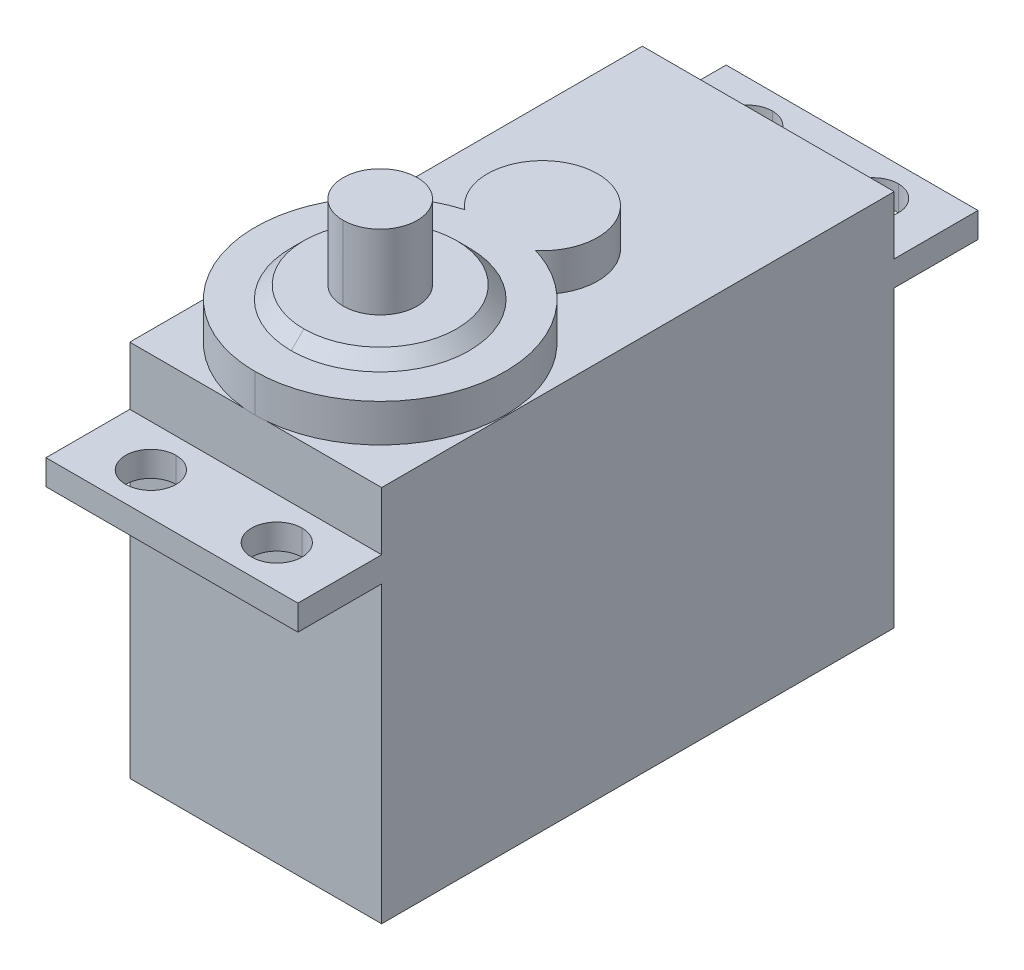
ISO-10303-21;
HEADER;
FILE_DESCRIPTION(('STEP AP214'),'2;1');
FILE_NAME('part.step','',(''),(''),'','','');
FILE_SCHEMA(('AUTOMOTIVE_DESIGN { 1 0 10303 214 1 1 1 1 }'));
ENDSEC;
DATA;
#1=APPLICATION_CONTEXT('core data for automotive mechanical design processes');
#2=APPLICATION_PROTOCOL_DEFINITION('international standard','automotive_design',2000,#1);
#3=PRODUCT_CONTEXT('',#1,'mechanical');
#4=PRODUCT('Part','Part','',(#3));
#5=PRODUCT_RELATED_PRODUCT_CATEGORY('part','',(#4));
#6=PRODUCT_DEFINITION_FORMATION('','',#4);
#7=PRODUCT_DEFINITION_CONTEXT('part definition',#1,'design');
#8=PRODUCT_DEFINITION('design','',#6,#7);
#9=PRODUCT_DEFINITION_SHAPE('','',#8);
#10=(LENGTH_UNIT() NAMED_UNIT(*) SI_UNIT(.MILLI.,.METRE.));
#11=(NAMED_UNIT(*) PLANE_ANGLE_UNIT() SI_UNIT($,.RADIAN.));
#12=(NAMED_UNIT(*) SI_UNIT($,.STERADIAN.) SOLID_ANGLE_UNIT());
#13=UNCERTAINTY_MEASURE_WITH_UNIT(LENGTH_MEASURE(1.E-05),#10,'distance_accuracy_value','');
#14=(GEOMETRIC_REPRESENTATION_CONTEXT(3) GLOBAL_UNCERTAINTY_ASSIGNED_CONTEXT((#13)) GLOBAL_UNIT_ASSIGNED_CONTEXT((#10,
#11,#12)) REPRESENTATION_CONTEXT('',''));
#15=CARTESIAN_POINT('',(0.,0.,0.));
#16=DIRECTION('',(0.,0.,1.));
#17=DIRECTION('',(1.,0.,0.));
#18=AXIS2_PLACEMENT_3D('',#15,#16,#17);
#19=CARTESIAN_POINT('',(-10.,10.3784797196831,-20.35));
#20=DIRECTION('',(0.,0.,-1.));
#21=DIRECTION('',(0.,1.,0.));
#22=AXIS2_PLACEMENT_3D('',#19,#20,#21);
#23=PLANE('',#22);
#24=CARTESIAN_POINT('',(-10.,10.3784797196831,-20.35));
#25=DIRECTION('',(1.,0.,0.));
#26=VECTOR('',#25,1.);
#27=LINE('',#24,#26);
#28=CARTESIAN_POINT('',(-10.,10.3784797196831,-20.35));
#29=VERTEX_POINT('',#28);
#30=CARTESIAN_POINT('',(10.,10.3784797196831,-20.35));
#31=VERTEX_POINT('',#30);
#32=EDGE_CURVE('E11',#29,#31,#27,.T.);
#33=ORIENTED_EDGE('',*,*,#32,.F.);
#34=CARTESIAN_POINT('',(-10.,15.,-20.35));
#35=DIRECTION('',(0.,-1.,0.));
#36=VECTOR('',#35,1.);
#37=LINE('',#34,#36);
#38=CARTESIAN_POINT('',(-10.,15.,-20.35));
#39=VERTEX_POINT('',#38);
#40=EDGE_CURVE('E25',#39,#29,#37,.T.);
#41=ORIENTED_EDGE('',*,*,#40,.F.);
#42=CARTESIAN_POINT('',(10.,15.,-20.35));
#43=DIRECTION('',(-1.,0.,0.));
#44=VECTOR('',#43,1.);
#45=LINE('',#42,#44);
#46=CARTESIAN_POINT('',(10.,15.,-20.35));
#47=VERTEX_POINT('',#46);
#48=EDGE_CURVE('E2218',#47,#39,#45,.T.);
#49=ORIENTED_EDGE('',*,*,#48,.F.);
#50=CARTESIAN_POINT('',(10.,15.,-20.35));
#51=DIRECTION('',(0.,-1.,0.));
#52=VECTOR('',#51,1.);
#53=LINE('',#50,#52);
#54=EDGE_CURVE('E2042',#47,#31,#53,.T.);
#55=ORIENTED_EDGE('',*,*,#54,.T.);
#56=EDGE_LOOP('',(#33,#41,#49,#55));
#57=FACE_BOUND('',#56,.T.);
#58=ADVANCED_FACE('F16',(#57),#23,.T.);
#59=CARTESIAN_POINT('',(9.99999999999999,-15.,-27.));
#60=DIRECTION('',(1.,0.,0.));
#61=DIRECTION('',(0.,1.,0.));
#62=AXIS2_PLACEMENT_3D('',#59,#60,#61);
#63=PLANE('',#62);
#64=CARTESIAN_POINT('',(10.,-15.,20.35));
#65=DIRECTION('',(0.,0.,-1.));
#66=VECTOR('',#65,1.);
#67=LINE('',#64,#66);
#68=CARTESIAN_POINT('',(10.,-15.,20.35));
#69=VERTEX_POINT('',#68);
#70=CARTESIAN_POINT('',(10.,-15.,-20.35));
#71=VERTEX_POINT('',#70);
#72=EDGE_CURVE('E1534',#69,#71,#67,.T.);
#73=ORIENTED_EDGE('',*,*,#72,.T.);
#74=CARTESIAN_POINT('',(10.,8.3784797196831,-20.35));
#75=DIRECTION('',(0.,-1.,0.));
#76=VECTOR('',#75,1.);
#77=LINE('',#74,#76);
#78=CARTESIAN_POINT('',(10.,8.37847971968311,-20.35));
#79=VERTEX_POINT('',#78);
#80=EDGE_CURVE('E1533',#79,#71,#77,.T.);
#81=ORIENTED_EDGE('',*,*,#80,.F.);
#82=CARTESIAN_POINT('',(10.,8.37847971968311,-27.));
#83=DIRECTION('',(0.,0.,1.));
#84=VECTOR('',#83,1.);
#85=LINE('',#82,#84);
#86=CARTESIAN_POINT('',(9.99999999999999,8.37847971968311,-27.));
#87=VERTEX_POINT('',#86);
#88=EDGE_CURVE('E1321',#87,#79,#85,.T.);
#89=ORIENTED_EDGE('',*,*,#88,.F.);
#90=CARTESIAN_POINT('',(10.,10.3784797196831,-27.));
#91=DIRECTION('',(0.,-1.,0.));
#92=VECTOR('',#91,1.);
#93=LINE('',#90,#92);
#94=CARTESIAN_POINT('',(10.,10.3784797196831,-27.));
#95=VERTEX_POINT('',#94);
#96=EDGE_CURVE('E1178',#95,#87,#93,.T.);
#97=ORIENTED_EDGE('',*,*,#96,.F.);
#98=CARTESIAN_POINT('',(9.99999999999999,10.3784797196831,-27.));
#99=DIRECTION('',(0.,0.,1.));
#100=VECTOR('',#99,1.);
#101=LINE('',#98,#100);
#102=EDGE_CURVE('E1316',#95,#31,#101,.T.);
#103=ORIENTED_EDGE('',*,*,#102,.T.);
#104=ORIENTED_EDGE('',*,*,#54,.F.);
#105=CARTESIAN_POINT('',(10.,15.,20.35));
#106=DIRECTION('',(0.,0.,-1.));
#107=VECTOR('',#106,1.);
#108=LINE('',#105,#107);
#109=CARTESIAN_POINT('',(10.,15.,20.35));
#110=VERTEX_POINT('',#109);
#111=EDGE_CURVE('E1320',#110,#47,#108,.T.);
#112=ORIENTED_EDGE('',*,*,#111,.F.);
#113=CARTESIAN_POINT('',(10.,15.,20.35));
#114=DIRECTION('',(0.,-1.,0.));
#115=VECTOR('',#114,1.);
#116=LINE('',#113,#115);
#117=CARTESIAN_POINT('',(10.,10.3784797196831,20.35));
#118=VERTEX_POINT('',#117);
#119=EDGE_CURVE('E1072',#110,#118,#116,.T.);
#120=ORIENTED_EDGE('',*,*,#119,.T.);
#121=CARTESIAN_POINT('',(10.,10.3784797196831,27.));
#122=DIRECTION('',(0.,0.,-1.));
#123=VECTOR('',#122,1.);
#124=LINE('',#121,#123);
#125=CARTESIAN_POINT('',(10.,10.3784797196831,27.));
#126=VERTEX_POINT('',#125);
#127=EDGE_CURVE('E412',#126,#118,#124,.T.);
#128=ORIENTED_EDGE('',*,*,#127,.F.);
#129=CARTESIAN_POINT('',(10.,8.37847971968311,27.));
#130=DIRECTION('',(0.,1.,0.));
#131=VECTOR('',#130,1.);
#132=LINE('',#129,#131);
#133=CARTESIAN_POINT('',(10.,8.37847971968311,27.));
#134=VERTEX_POINT('',#133);
#135=EDGE_CURVE('E295',#134,#126,#132,.T.);
#136=ORIENTED_EDGE('',*,*,#135,.F.);
#137=CARTESIAN_POINT('',(10.,8.3784797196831,27.));
#138=DIRECTION('',(0.,0.,-1.));
#139=VECTOR('',#138,1.);
#140=LINE('',#137,#139);
#141=CARTESIAN_POINT('',(10.,8.37847971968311,20.35));
#142=VERTEX_POINT('',#141);
#143=EDGE_CURVE('E406',#134,#142,#140,.T.);
#144=ORIENTED_EDGE('',*,*,#143,.T.);
#145=CARTESIAN_POINT('',(10.,8.3784797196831,20.35));
#146=DIRECTION('',(0.,-1.,0.));
#147=VECTOR('',#146,1.);
#148=LINE('',#145,#147);
#149=EDGE_CURVE('E411',#142,#69,#148,.T.);
#150=ORIENTED_EDGE('',*,*,#149,.T.);
#151=EDGE_LOOP('',(#73,#81,#89,#97,#103,#104,#112,#120,#128,#136,#144,#150));
#152=FACE_BOUND('',#151,.T.);
#153=ADVANCED_FACE('F1454',(#152),#63,.T.);
#154=CARTESIAN_POINT('',(10.,-15.,20.35));
#155=DIRECTION('',(0.,0.,1.));
#156=DIRECTION('',(0.,1.,0.));
#157=AXIS2_PLACEMENT_3D('',#154,#155,#156);
#158=PLANE('',#157);
#159=CARTESIAN_POINT('',(-10.,8.37847971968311,20.35));
#160=DIRECTION('',(1.,0.,0.));
#161=VECTOR('',#160,1.);
#162=LINE('',#159,#161);
#163=CARTESIAN_POINT('',(-10.,8.37847971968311,20.35));
#164=VERTEX_POINT('',#163);
#165=EDGE_CURVE('E407',#164,#142,#162,.T.);
#166=ORIENTED_EDGE('',*,*,#165,.F.);
#167=CARTESIAN_POINT('',(-10.,8.3784797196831,20.35));
#168=DIRECTION('',(0.,-1.,0.));
#169=VECTOR('',#168,1.);
#170=LINE('',#167,#169);
#171=CARTESIAN_POINT('',(-10.,-15.,20.35));
#172=VERTEX_POINT('',#171);
#173=EDGE_CURVE('E415',#164,#172,#170,.T.);
#174=ORIENTED_EDGE('',*,*,#173,.T.);
#175=CARTESIAN_POINT('',(-10.,-15.,20.35));
#176=DIRECTION('',(1.,0.,0.));
#177=VECTOR('',#176,1.);
#178=LINE('',#175,#177);
#179=EDGE_CURVE('E416',#172,#69,#178,.T.);
#180=ORIENTED_EDGE('',*,*,#179,.T.);
#181=ORIENTED_EDGE('',*,*,#149,.F.);
#182=EDGE_LOOP('',(#166,#174,#180,#181));
#183=FACE_BOUND('',#182,.T.);
#184=ADVANCED_FACE('F1459',(#183),#158,.T.);
#185=CARTESIAN_POINT('',(-10.,-15.,-20.35));
#186=DIRECTION('',(0.,-1.,0.));
#187=DIRECTION('',(1.,0.,0.));
#188=AXIS2_PLACEMENT_3D('',#185,#186,#187);
#189=PLANE('',#188);
#190=ORIENTED_EDGE('',*,*,#72,.F.);
#191=ORIENTED_EDGE('',*,*,#179,.F.);
#192=CARTESIAN_POINT('',(-10.,-15.,-20.35));
#193=DIRECTION('',(0.,0.,1.));
#194=VECTOR('',#193,1.);
#195=LINE('',#192,#194);
#196=CARTESIAN_POINT('',(-10.,-15.,-20.35));
#197=VERTEX_POINT('',#196);
#198=EDGE_CURVE('E421',#197,#172,#195,.T.);
#199=ORIENTED_EDGE('',*,*,#198,.F.);
#200=CARTESIAN_POINT('',(10.,-15.,-20.35));
#201=DIRECTION('',(-1.,0.,0.));
#202=VECTOR('',#201,1.);
#203=LINE('',#200,#202);
#204=EDGE_CURVE('E425',#71,#197,#203,.T.);
#205=ORIENTED_EDGE('',*,*,#204,.F.);
#206=EDGE_LOOP('',(#190,#191,#199,#205));
#207=FACE_BOUND('',#206,.T.);
#208=ADVANCED_FACE('F1463',(#207),#189,.T.);
#209=CARTESIAN_POINT('',(-10.,-15.,-20.35));
#210=DIRECTION('',(0.,0.,-1.));
#211=DIRECTION('',(0.,1.,0.));
#212=AXIS2_PLACEMENT_3D('',#209,#210,#211);
#213=PLANE('',#212);
#214=CARTESIAN_POINT('',(10.,8.37847971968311,-20.35));
#215=DIRECTION('',(-1.,0.,0.));
#216=VECTOR('',#215,1.);
#217=LINE('',#214,#216);
#218=CARTESIAN_POINT('',(-10.,8.37847971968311,-20.35));
#219=VERTEX_POINT('',#218);
#220=EDGE_CURVE('E430',#79,#219,#217,.T.);
#221=ORIENTED_EDGE('',*,*,#220,.F.);
#222=ORIENTED_EDGE('',*,*,#80,.T.);
#223=ORIENTED_EDGE('',*,*,#204,.T.);
#224=CARTESIAN_POINT('',(-10.,8.3784797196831,-20.35));
#225=DIRECTION('',(0.,-1.,0.));
#226=VECTOR('',#225,1.);
#227=LINE('',#224,#226);
#228=EDGE_CURVE('E436',#219,#197,#227,.T.);
#229=ORIENTED_EDGE('',*,*,#228,.F.);
#230=EDGE_LOOP('',(#221,#222,#223,#229));
#231=FACE_BOUND('',#230,.T.);
#232=ADVANCED_FACE('F1537',(#231),#213,.T.);
#233=CARTESIAN_POINT('',(-10.,-15.,27.));
#234=DIRECTION('',(-1.,0.,0.));
#235=DIRECTION('',(0.,1.,0.));
#236=AXIS2_PLACEMENT_3D('',#233,#234,#235);
#237=PLANE('',#236);
#238=ORIENTED_EDGE('',*,*,#198,.T.);
#239=ORIENTED_EDGE('',*,*,#173,.F.);
#240=CARTESIAN_POINT('',(-10.,8.37847971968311,27.));
#241=DIRECTION('',(0.,0.,-1.));
#242=VECTOR('',#241,1.);
#243=LINE('',#240,#242);
#244=CARTESIAN_POINT('',(-10.,8.37847971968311,27.));
#245=VERTEX_POINT('',#244);
#246=EDGE_CURVE('E442',#245,#164,#243,.T.);
#247=ORIENTED_EDGE('',*,*,#246,.F.);
#248=CARTESIAN_POINT('',(-10.,10.3784797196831,27.));
#249=DIRECTION('',(0.,-1.,0.));
#250=VECTOR('',#249,1.);
#251=LINE('',#248,#250);
#252=CARTESIAN_POINT('',(-10.,10.3784797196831,27.));
#253=VERTEX_POINT('',#252);
#254=EDGE_CURVE('E274',#253,#245,#251,.T.);
#255=ORIENTED_EDGE('',*,*,#254,.F.);
#256=CARTESIAN_POINT('',(-10.,10.3784797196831,27.));
#257=DIRECTION('',(0.,0.,-1.));
#258=VECTOR('',#257,1.);
#259=LINE('',#256,#258);
#260=CARTESIAN_POINT('',(-10.,10.3784797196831,20.35));
#261=VERTEX_POINT('',#260);
#262=EDGE_CURVE('E445',#253,#261,#259,.T.);
#263=ORIENTED_EDGE('',*,*,#262,.T.);
#264=CARTESIAN_POINT('',(-10.,15.,20.35));
#265=DIRECTION('',(0.,-1.,0.));
#266=VECTOR('',#265,1.);
#267=LINE('',#264,#266);
#268=CARTESIAN_POINT('',(-10.,15.,20.35));
#269=VERTEX_POINT('',#268);
#270=EDGE_CURVE('E446',#269,#261,#267,.T.);
#271=ORIENTED_EDGE('',*,*,#270,.F.);
#272=CARTESIAN_POINT('',(-10.,15.,-20.35));
#273=DIRECTION('',(0.,0.,1.));
#274=VECTOR('',#273,1.);
#275=LINE('',#272,#274);
#276=EDGE_CURVE('E449',#39,#269,#275,.T.);
#277=ORIENTED_EDGE('',*,*,#276,.F.);
#278=ORIENTED_EDGE('',*,*,#40,.T.);
#279=CARTESIAN_POINT('',(-10.,10.3784797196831,-27.));
#280=DIRECTION('',(0.,0.,1.));
#281=VECTOR('',#280,1.);
#282=LINE('',#279,#281);
#283=CARTESIAN_POINT('',(-10.,10.3784797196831,-27.));
#284=VERTEX_POINT('',#283);
#285=EDGE_CURVE('E456',#284,#29,#282,.T.);
#286=ORIENTED_EDGE('',*,*,#285,.F.);
#287=CARTESIAN_POINT('',(-10.,8.37847971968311,-27.));
#288=DIRECTION('',(0.,1.,0.));
#289=VECTOR('',#288,1.);
#290=LINE('',#287,#289);
#291=CARTESIAN_POINT('',(-10.,8.37847971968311,-27.));
#292=VERTEX_POINT('',#291);
#293=EDGE_CURVE('E461',#292,#284,#290,.T.);
#294=ORIENTED_EDGE('',*,*,#293,.F.);
#295=CARTESIAN_POINT('',(-10.,8.3784797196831,-27.));
#296=DIRECTION('',(0.,0.,1.));
#297=VECTOR('',#296,1.);
#298=LINE('',#295,#297);
#299=EDGE_CURVE('E466',#292,#219,#298,.T.);
#300=ORIENTED_EDGE('',*,*,#299,.T.);
#301=ORIENTED_EDGE('',*,*,#228,.T.);
#302=EDGE_LOOP('',(#238,#239,#247,#255,#263,#271,#277,#278,#286,#294,#300,#301));
#303=FACE_BOUND('',#302,.T.);
#304=ADVANCED_FACE('F1563',(#303),#237,.T.);
#305=CARTESIAN_POINT('',(10.,8.37847971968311,-27.));
#306=DIRECTION('',(0.,-1.,0.));
#307=DIRECTION('',(0.,0.,1.));
#308=AXIS2_PLACEMENT_3D('',#305,#306,#307);
#309=PLANE('',#308);
#310=ORIENTED_EDGE('',*,*,#220,.T.);
#311=ORIENTED_EDGE('',*,*,#299,.F.);
#312=CARTESIAN_POINT('',(10.,8.37847971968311,-27.));
#313=DIRECTION('',(-1.,0.,0.));
#314=VECTOR('',#313,1.);
#315=LINE('',#312,#314);
#316=EDGE_CURVE('E471',#87,#292,#315,.T.);
#317=ORIENTED_EDGE('',*,*,#316,.F.);
#318=ORIENTED_EDGE('',*,*,#88,.T.);
#319=EDGE_LOOP('',(#310,#311,#317,#318));
#320=FACE_BOUND('',#319,.T.);
#321=CARTESIAN_POINT('',(5.00000000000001,8.3784797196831,-23.675));
#322=DIRECTION('',(0.,-1.,0.));
#323=DIRECTION('',(0.,0.,1.));
#324=AXIS2_PLACEMENT_3D('',#321,#322,#323);
#325=CIRCLE('',#324,2.);
#326=CARTESIAN_POINT('',(5.00000000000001,8.3784797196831,-21.675));
#327=VERTEX_POINT('',#326);
#328=CARTESIAN_POINT('',(5.00000000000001,8.37847971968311,-25.675));
#329=VERTEX_POINT('',#328);
#330=EDGE_CURVE('E473',#327,#329,#325,.T.);
#331=ORIENTED_EDGE('',*,*,#330,.F.);
#332=CARTESIAN_POINT('',(5.00000000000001,8.3784797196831,-23.675));
#333=DIRECTION('',(0.,-1.,0.));
#334=DIRECTION('',(0.,0.,-1.));
#335=AXIS2_PLACEMENT_3D('',#332,#333,#334);
#336=CIRCLE('',#335,2.);
#337=EDGE_CURVE('E478',#329,#327,#336,.T.);
#338=ORIENTED_EDGE('',*,*,#337,.F.);
#339=EDGE_LOOP('',(#331,#338));
#340=FACE_BOUND('',#339,.T.);
#341=CARTESIAN_POINT('',(-5.,8.37847971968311,-25.675));
#342=CARTESIAN_POINT('',(-5.0629280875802,8.37847971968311,-25.674997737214));
#343=CARTESIAN_POINT('',(-5.1258724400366,8.37847971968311,-25.6720325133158));
#344=CARTESIAN_POINT('',(-5.398994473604,8.37847971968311,-25.6461994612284));
#345=CARTESIAN_POINT('',(-5.5933178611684,8.37847971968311,-25.5950965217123));
#346=CARTESIAN_POINT('',(-6.0125241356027,8.37847971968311,-25.4190099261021));
#347=CARTESIAN_POINT('',(-6.211075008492,8.37847971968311,-25.2835122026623));
#348=CARTESIAN_POINT('',(-6.7820742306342,8.37847971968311,-24.7394100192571));
#349=CARTESIAN_POINT('',(-6.9997763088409,8.37847971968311,-24.216518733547));
#350=CARTESIAN_POINT('',(-6.9999014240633,8.37847971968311,-23.3607676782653));
#351=CARTESIAN_POINT('',(-6.926089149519,8.37847971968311,-23.0512628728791));
#352=CARTESIAN_POINT('',(-6.6725009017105,8.37847971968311,-22.5509179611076));
#353=CARTESIAN_POINT('',(-6.5212075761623,8.37847971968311,-22.3534017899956));
#354=CARTESIAN_POINT('',(-6.2161028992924,8.37847971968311,-22.0788080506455));
#355=CARTESIAN_POINT('',(-6.0813467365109,8.37847971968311,-21.9845858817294));
#356=CARTESIAN_POINT('',(-5.7754587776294,8.37847971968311,-21.8224331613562));
#357=CARTESIAN_POINT('',(-5.6005798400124,8.37847971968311,-21.7571558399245));
#358=CARTESIAN_POINT('',(-5.2736121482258,8.37847971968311,-21.6890962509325));
#359=CARTESIAN_POINT('',(-5.1369945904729,8.37847971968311,-21.6750429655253));
#360=CARTESIAN_POINT('',(-5.,8.37847971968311,-21.675));
#361=B_SPLINE_CURVE_WITH_KNOTS('',3,(#341,#342,#343,#344,#345,#346,#347,#348,#349,#350,#351,
#352,#353,#354,#355,#356,#357,#358,#359,#360),.UNSPECIFIED.,.F.,.F.,(4,2,2,2,2,2,2,2,2,4),(0.,
0.0253686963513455,0.110458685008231,0.222421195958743,0.48969260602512,0.644784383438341,
0.766513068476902,0.847349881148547,0.937365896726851,1.),.UNSPECIFIED.);
#362=CARTESIAN_POINT('',(-5.,8.37847971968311,-25.675));
#363=VERTEX_POINT('',#362);
#364=CARTESIAN_POINT('',(-5.00000000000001,8.37847971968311,-21.675));
#365=VERTEX_POINT('',#364);
#366=EDGE_CURVE('E485',#363,#365,#361,.T.);
#367=ORIENTED_EDGE('',*,*,#366,.T.);
#368=CARTESIAN_POINT('',(-5.,8.37847971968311,-21.675));
#369=CARTESIAN_POINT('',(-4.8179109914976,8.37847971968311,-21.6750752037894));
#370=CARTESIAN_POINT('',(-4.63673859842,8.37847971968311,-21.6998688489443));
#371=CARTESIAN_POINT('',(-4.2356037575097,8.37847971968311,-21.8120055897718));
#372=CARTESIAN_POINT('',(-4.0426414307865,8.37847971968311,-21.9067087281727));
#373=CARTESIAN_POINT('',(-3.6511532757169,8.37847971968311,-22.1745913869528));
#374=CARTESIAN_POINT('',(-3.4671734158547,8.37847971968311,-22.3643491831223));
#375=CARTESIAN_POINT('',(-2.9643476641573,8.37847971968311,-23.1346791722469));
#376=CARTESIAN_POINT('',(-2.8994564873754,8.37847971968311,-23.8305774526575));
#377=CARTESIAN_POINT('',(-3.2409886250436,8.37847971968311,-24.6546690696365));
#378=CARTESIAN_POINT('',(-3.3664354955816,8.37847971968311,-24.8518533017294));
#379=CARTESIAN_POINT('',(-3.6928373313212,8.37847971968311,-25.2094405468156));
#380=CARTESIAN_POINT('',(-3.8996887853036,8.37847971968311,-25.3685988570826));
#381=CARTESIAN_POINT('',(-4.3181559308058,8.37847971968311,-25.5639324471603));
#382=CARTESIAN_POINT('',(-4.4940455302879,8.37847971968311,-25.6196639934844));
#383=CARTESIAN_POINT('',(-4.7891511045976,8.37847971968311,-25.6666879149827));
#384=CARTESIAN_POINT('',(-4.8945527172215,8.37847971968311,-25.6750038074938));
#385=CARTESIAN_POINT('',(-5.,8.37847971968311,-25.675));
#386=B_SPLINE_CURVE_WITH_KNOTS('',3,(#368,#369,#370,#371,#372,#373,#374,#375,#376,#377,#378,
#379,#380,#381,#382,#383,#384,#385),.UNSPECIFIED.,.F.,.F.,(4,2,2,2,2,2,2,2,4),(0.,
0.0784262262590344,0.17933765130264,0.308319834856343,0.635674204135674,0.750681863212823,
0.875735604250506,0.956098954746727,1.),.UNSPECIFIED.);
#387=EDGE_CURVE('E489',#365,#363,#386,.T.);
#388=ORIENTED_EDGE('',*,*,#387,.T.);
#389=EDGE_LOOP('',(#367,#388));
#390=FACE_BOUND('',#389,.T.);
#391=ADVANCED_FACE('F1542',(#320,#340,#390),#309,.T.);
#392=CARTESIAN_POINT('',(-5.00000000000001,8.37847971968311,-23.675));
#393=DIRECTION('',(0.,1.,0.));
#394=DIRECTION('',(-1.,0.,0.));
#395=AXIS2_PLACEMENT_3D('',#392,#393,#394);
#396=CYLINDRICAL_SURFACE('',#395,2.);
#397=ORIENTED_EDGE('',*,*,#387,.F.);
#398=CARTESIAN_POINT('',(-5.,8.37847971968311,-21.675));
#399=DIRECTION('',(0.,1.,0.));
#400=VECTOR('',#399,1.);
#401=LINE('',#398,#400);
#402=CARTESIAN_POINT('',(-5.00000000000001,10.3784797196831,-21.675));
#403=VERTEX_POINT('',#402);
#404=EDGE_CURVE('E494',#365,#403,#401,.T.);
#405=ORIENTED_EDGE('',*,*,#404,.T.);
#406=CARTESIAN_POINT('',(-5.00000000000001,10.3784797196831,-23.675));
#407=DIRECTION('',(0.,1.,0.));
#408=DIRECTION('',(0.,0.,1.));
#409=AXIS2_PLACEMENT_3D('',#406,#407,#408);
#410=CIRCLE('',#409,2.);
#411=CARTESIAN_POINT('',(-4.99999999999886,10.3784797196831,-25.6750000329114));
#412=VERTEX_POINT('',#411);
#413=EDGE_CURVE('E497',#403,#412,#410,.T.);
#414=ORIENTED_EDGE('',*,*,#413,.T.);
#415=CARTESIAN_POINT('',(-4.99999999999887,10.3784797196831,-25.675));
#416=DIRECTION('',(-5.6942298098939E-13,-1.,0.));
#417=VECTOR('',#416,1.);
#418=LINE('',#415,#417);
#419=EDGE_CURVE('E502',#412,#363,#418,.T.);
#420=ORIENTED_EDGE('',*,*,#419,.T.);
#421=EDGE_LOOP('',(#397,#405,#414,#420));
#422=FACE_BOUND('',#421,.T.);
#423=ADVANCED_FACE('F1562',(#422),#396,.F.);
#424=CARTESIAN_POINT('',(-5.00000000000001,8.37847971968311,-23.675));
#425=DIRECTION('',(0.,1.,0.));
#426=DIRECTION('',(1.,0.,2.85832638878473E-13));
#427=AXIS2_PLACEMENT_3D('',#424,#425,#426);
#428=CYLINDRICAL_SURFACE('',#427,2.);
#429=CARTESIAN_POINT('',(-5.00000000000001,10.3784797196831,-23.675));
#430=DIRECTION('',(0.,1.,0.));
#431=DIRECTION('',(5.72458747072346E-13,0.,-1.));
#432=AXIS2_PLACEMENT_3D('',#429,#430,#431);
#433=CIRCLE('',#432,2.);
#434=EDGE_CURVE('E506',#412,#403,#433,.T.);
#435=ORIENTED_EDGE('',*,*,#434,.T.);
#436=ORIENTED_EDGE('',*,*,#404,.F.);
#437=ORIENTED_EDGE('',*,*,#366,.F.);
#438=ORIENTED_EDGE('',*,*,#419,.F.);
#439=EDGE_LOOP('',(#435,#436,#437,#438));
#440=FACE_BOUND('',#439,.T.);
#441=ADVANCED_FACE('F1269',(#440),#428,.F.);
#442=CARTESIAN_POINT('',(-10.,10.3784797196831,-20.35));
#443=DIRECTION('',(0.,1.,0.));
#444=DIRECTION('',(1.,0.,0.));
#445=AXIS2_PLACEMENT_3D('',#442,#443,#444);
#446=PLANE('',#445);
#447=ORIENTED_EDGE('',*,*,#32,.T.);
#448=ORIENTED_EDGE('',*,*,#102,.F.);
#449=CARTESIAN_POINT('',(-10.,10.3784797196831,-27.));
#450=DIRECTION('',(1.,0.,0.));
#451=VECTOR('',#450,1.);
#452=LINE('',#449,#451);
#453=EDGE_CURVE('E508',#284,#95,#452,.T.);
#454=ORIENTED_EDGE('',*,*,#453,.F.);
#455=ORIENTED_EDGE('',*,*,#285,.T.);
#456=EDGE_LOOP('',(#447,#448,#454,#455));
#457=FACE_BOUND('',#456,.T.);
#458=ORIENTED_EDGE('',*,*,#413,.F.);
#459=ORIENTED_EDGE('',*,*,#434,.F.);
#460=EDGE_LOOP('',(#458,#459));
#461=FACE_BOUND('',#460,.T.);
#462=CARTESIAN_POINT('',(5.0000000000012,10.3784797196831,-25.6750000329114));
#463=CARTESIAN_POINT('',(5.0698814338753,10.3784797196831,-25.6750002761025));
#464=CARTESIAN_POINT('',(5.139767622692,10.3784797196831,-25.6713487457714));
#465=CARTESIAN_POINT('',(5.3246876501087,10.3784797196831,-25.6519259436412));
#466=CARTESIAN_POINT('',(5.4336347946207,10.3784797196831,-25.6308015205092));
#467=CARTESIAN_POINT('',(5.6444257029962,10.3784797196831,-25.5720350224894));
#468=CARTESIAN_POINT('',(5.7459020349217,10.3784797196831,-25.5338557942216));
#469=CARTESIAN_POINT('',(6.0992713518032,10.3784797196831,-25.3695380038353));
#470=CARTESIAN_POINT('',(6.3069487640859,10.3784797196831,-25.2097706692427));
#471=CARTESIAN_POINT('',(7.0019658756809,10.3784797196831,-24.4479625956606));
#472=CARTESIAN_POINT('',(7.1456096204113,10.3784797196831,-23.6211499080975));
#473=CARTESIAN_POINT('',(6.7435028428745,10.3784797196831,-22.6603961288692));
#474=CARTESIAN_POINT('',(6.5950111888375,10.3784797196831,-22.4401279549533));
#475=CARTESIAN_POINT('',(6.2842034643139,10.3784797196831,-22.1319085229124));
#476=CARTESIAN_POINT('',(6.1446150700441,10.3784797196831,-22.0256714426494));
#477=CARTESIAN_POINT('',(5.8256752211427,10.3784797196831,-21.8431912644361));
#478=CARTESIAN_POINT('',(5.6419433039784,10.3784797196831,-21.7688963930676));
#479=CARTESIAN_POINT('',(5.2916619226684,10.3784797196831,-21.6910254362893));
#480=CARTESIAN_POINT('',(5.1460624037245,10.3784797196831,-21.6750602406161));
#481=CARTESIAN_POINT('',(5.,10.3784797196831,-21.675));
#482=B_SPLINE_CURVE_WITH_KNOTS('',3,(#462,#463,#464,#465,#466,#467,#468,#469,#470,#471,#472,
#473,#474,#475,#476,#477,#478,#479,#480,#481),.UNSPECIFIED.,.F.,.F.,(4,2,2,2,2,2,2,2,2,4),(0.,
0.0274044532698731,0.0728599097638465,0.119860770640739,0.244050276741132,0.625851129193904,
0.754855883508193,0.840507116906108,0.935056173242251,1.),.UNSPECIFIED.);
#483=CARTESIAN_POINT('',(5.00000000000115,10.3784797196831,-25.6750000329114));
#484=VERTEX_POINT('',#483);
#485=CARTESIAN_POINT('',(5.,10.3784797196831,-21.675));
#486=VERTEX_POINT('',#485);
#487=EDGE_CURVE('E512',#484,#486,#482,.T.);
#488=ORIENTED_EDGE('',*,*,#487,.T.);
#489=CARTESIAN_POINT('',(5.,10.3784797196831,-21.675));
#490=CARTESIAN_POINT('',(4.8314427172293,10.3784797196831,-21.6750695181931));
#491=CARTESIAN_POINT('',(4.6636077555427,10.3784797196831,-21.6963202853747));
#492=CARTESIAN_POINT('',(4.2929731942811,10.3784797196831,-21.7918977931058));
#493=CARTESIAN_POINT('',(4.1104211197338,10.3784797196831,-21.8731897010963));
#494=CARTESIAN_POINT('',(3.7354466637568,10.3784797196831,-22.1060101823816));
#495=CARTESIAN_POINT('',(3.555592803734,10.3784797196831,-22.2710336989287));
#496=CARTESIAN_POINT('',(2.9904133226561,10.3784797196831,-23.0117508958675));
#497=CARTESIAN_POINT('',(2.8845633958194,10.3784797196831,-23.7398078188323));
#498=CARTESIAN_POINT('',(3.2160647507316,10.3784797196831,-24.6105673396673));
#499=CARTESIAN_POINT('',(3.3411361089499,10.3784797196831,-24.8175822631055));
#500=CARTESIAN_POINT('',(3.6030885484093,10.3784797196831,-25.1146595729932));
#501=CARTESIAN_POINT('',(3.7197154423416,10.3784797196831,-25.2193183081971));
#502=CARTESIAN_POINT('',(3.9986312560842,10.3784797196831,-25.4161368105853));
#503=CARTESIAN_POINT('',(4.1660566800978,10.3784797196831,-25.5034402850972));
#504=CARTESIAN_POINT('',(4.481295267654,10.3784797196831,-25.6115234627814));
#505=CARTESIAN_POINT('',(4.6153642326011,10.3784797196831,-25.6425264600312));
#506=CARTESIAN_POINT('',(4.8340219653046,10.3784797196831,-25.6698488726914));
#507=CARTESIAN_POINT('',(4.9170076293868,10.3784797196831,-25.6749997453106));
#508=CARTESIAN_POINT('',(5.0000000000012,10.3784797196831,-25.6750000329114));
#509=B_SPLINE_CURVE_WITH_KNOTS('',3,(#489,#490,#491,#492,#493,#494,#495,#496,#497,#498,#499,
#500,#501,#502,#503,#504,#505,#506,#507,#508),.UNSPECIFIED.,.F.,.F.,(4,2,2,2,2,2,2,2,2,4),(0.,
0.0723272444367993,0.164187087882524,0.280858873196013,0.616728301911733,0.733198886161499,
0.808997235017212,0.898919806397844,0.961902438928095,1.),.UNSPECIFIED.);
#510=EDGE_CURVE('E514',#486,#484,#509,.T.);
#511=ORIENTED_EDGE('',*,*,#510,.T.);
#512=EDGE_LOOP('',(#488,#511));
#513=FACE_BOUND('',#512,.T.);
#514=ADVANCED_FACE('F1260',(#457,#461,#513),#446,.T.);
#515=CARTESIAN_POINT('',(5.00000000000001,8.3784797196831,-23.675));
#516=DIRECTION('',(0.,1.,0.));
#517=DIRECTION('',(1.,0.,2.85388549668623E-13));
#518=AXIS2_PLACEMENT_3D('',#515,#516,#517);
#519=CYLINDRICAL_SURFACE('',#518,2.);
#520=ORIENTED_EDGE('',*,*,#510,.F.);
#521=CARTESIAN_POINT('',(5.00000000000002,8.3784797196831,-21.675));
#522=DIRECTION('',(0.,1.,0.));
#523=VECTOR('',#522,1.);
#524=LINE('',#521,#523);
#525=EDGE_CURVE('E519',#327,#486,#524,.T.);
#526=ORIENTED_EDGE('',*,*,#525,.F.);
#527=ORIENTED_EDGE('',*,*,#330,.T.);
#528=CARTESIAN_POINT('',(5.00000000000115,10.3784797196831,-25.675));
#529=DIRECTION('',(-5.69422980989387E-13,-1.,0.));
#530=VECTOR('',#529,1.);
#531=LINE('',#528,#530);
#532=EDGE_CURVE('E521',#484,#329,#531,.T.);
#533=ORIENTED_EDGE('',*,*,#532,.F.);
#534=EDGE_LOOP('',(#520,#526,#527,#533));
#535=FACE_BOUND('',#534,.T.);
#536=ADVANCED_FACE('F1191',(#535),#519,.F.);
#537=CARTESIAN_POINT('',(5.00000000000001,8.3784797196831,-23.675));
#538=DIRECTION('',(0.,1.,0.));
#539=DIRECTION('',(-1.,0.,0.));
#540=AXIS2_PLACEMENT_3D('',#537,#538,#539);
#541=CYLINDRICAL_SURFACE('',#540,2.);
#542=ORIENTED_EDGE('',*,*,#337,.T.);
#543=ORIENTED_EDGE('',*,*,#525,.T.);
#544=ORIENTED_EDGE('',*,*,#487,.F.);
#545=ORIENTED_EDGE('',*,*,#532,.T.);
#546=EDGE_LOOP('',(#542,#543,#544,#545));
#547=FACE_BOUND('',#546,.T.);
#548=ADVANCED_FACE('F1182',(#547),#541,.F.);
#549=CARTESIAN_POINT('',(-10.,8.37847971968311,-27.));
#550=DIRECTION('',(0.,0.,-1.));
#551=DIRECTION('',(0.,1.,0.));
#552=AXIS2_PLACEMENT_3D('',#549,#550,#551);
#553=PLANE('',#552);
#554=ORIENTED_EDGE('',*,*,#96,.T.);
#555=ORIENTED_EDGE('',*,*,#316,.T.);
#556=ORIENTED_EDGE('',*,*,#293,.T.);
#557=ORIENTED_EDGE('',*,*,#453,.T.);
#558=EDGE_LOOP('',(#554,#555,#556,#557));
#559=FACE_BOUND('',#558,.T.);
#560=ADVANCED_FACE('F1094',(#559),#553,.T.);
#561=CARTESIAN_POINT('',(-10.,15.,-20.35));
#562=DIRECTION('',(0.,1.,0.));
#563=DIRECTION('',(0.,0.,1.));
#564=AXIS2_PLACEMENT_3D('',#561,#562,#563);
#565=PLANE('',#564);
#566=CARTESIAN_POINT('',(0.,15.,10.4637902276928));
#567=DIRECTION('',(0.,1.,0.));
#568=DIRECTION('',(-0.282685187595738,0.,-0.959212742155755));
#569=AXIS2_PLACEMENT_3D('',#566,#567,#568);
#570=CIRCLE('',#569,9.92787760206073);
#571=CARTESIAN_POINT('',(-2.80646394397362,15.,0.940843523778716));
#572=VERTEX_POINT('',#571);
#573=CARTESIAN_POINT('',(-0.908630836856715,15.,20.350000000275));
#574=VERTEX_POINT('',#573);
#575=EDGE_CURVE('E523',#572,#574,#570,.T.);
#576=ORIENTED_EDGE('',*,*,#575,.F.);
#577=CARTESIAN_POINT('',(0.,15.,-2.42044969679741));
#578=DIRECTION('',(0.,1.,0.));
#579=DIRECTION('',(-7.45906530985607E-09,0.,-1.));
#580=AXIS2_PLACEMENT_3D('',#577,#578,#579);
#581=CIRCLE('',#580,4.37887340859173);
#582=CARTESIAN_POINT('',(-3.26627215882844E-08,15.,-6.79937986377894));
#583=VERTEX_POINT('',#582);
#584=EDGE_CURVE('E526',#583,#572,#581,.T.);
#585=ORIENTED_EDGE('',*,*,#584,.F.);
#586=CARTESIAN_POINT('',(0.,15.,-2.42044969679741));
#587=DIRECTION('',(0.,1.,0.));
#588=DIRECTION('',(0.640910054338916,0.,0.767615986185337));
#589=AXIS2_PLACEMENT_3D('',#586,#587,#588);
#590=CIRCLE('',#589,4.37887340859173);
#591=CARTESIAN_POINT('',(2.80646398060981,15.,0.940843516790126));
#592=VERTEX_POINT('',#591);
#593=EDGE_CURVE('E532',#592,#583,#590,.T.);
#594=ORIENTED_EDGE('',*,*,#593,.F.);
#595=CARTESIAN_POINT('',(0.,15.,10.4637902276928));
#596=DIRECTION('',(0.,1.,0.));
#597=DIRECTION('',(0.0915231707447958,0.,0.995802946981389));
#598=AXIS2_PLACEMENT_3D('',#595,#596,#597);
#599=CIRCLE('',#598,9.92787760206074);
#600=CARTESIAN_POINT('',(0.908630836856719,15.,20.35000000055));
#601=VERTEX_POINT('',#600);
#602=EDGE_CURVE('E538',#601,#592,#599,.T.);
#603=ORIENTED_EDGE('',*,*,#602,.F.);
#604=CARTESIAN_POINT('',(0.908630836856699,15.,20.35000000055));
#605=DIRECTION('',(1.,0.,-6.04966686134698E-11));
#606=VECTOR('',#605,1.);
#607=LINE('',#604,#606);
#608=EDGE_CURVE('E543',#601,#110,#607,.T.);
#609=ORIENTED_EDGE('',*,*,#608,.T.);
#610=ORIENTED_EDGE('',*,*,#111,.T.);
#611=ORIENTED_EDGE('',*,*,#48,.T.);
#612=ORIENTED_EDGE('',*,*,#276,.T.);
#613=CARTESIAN_POINT('',(-9.99999999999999,15.,20.35));
#614=DIRECTION('',(1.,0.,3.02487159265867E-11));
#615=VECTOR('',#614,1.);
#616=LINE('',#613,#615);
#617=EDGE_CURVE('E548',#269,#574,#616,.T.);
#618=ORIENTED_EDGE('',*,*,#617,.T.);
#619=EDGE_LOOP('',(#576,#585,#594,#603,#609,#610,#611,#612,#618));
#620=FACE_BOUND('',#619,.T.);
#621=ADVANCED_FACE('F1085',(#620),#565,.T.);
#622=CARTESIAN_POINT('',(10.,10.3784797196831,20.35));
#623=DIRECTION('',(0.,0.,1.));
#624=DIRECTION('',(0.,1.,0.));
#625=AXIS2_PLACEMENT_3D('',#622,#623,#624);
#626=PLANE('',#625);
#627=CARTESIAN_POINT('',(10.,10.3784797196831,20.35));
#628=DIRECTION('',(-1.,0.,0.));
#629=VECTOR('',#628,1.);
#630=LINE('',#627,#629);
#631=EDGE_CURVE('E553',#118,#261,#630,.T.);
#632=ORIENTED_EDGE('',*,*,#631,.F.);
#633=ORIENTED_EDGE('',*,*,#119,.F.);
#634=ORIENTED_EDGE('',*,*,#608,.F.);
#635=CARTESIAN_POINT('',(-0.908630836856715,15.,20.350000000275));
#636=CARTESIAN_POINT('',(-0.302876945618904,15.,20.3500000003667));
#637=CARTESIAN_POINT('',(0.302876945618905,15.,20.3500000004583));
#638=CARTESIAN_POINT('',(0.908630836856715,15.,20.35000000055));
#639=B_SPLINE_CURVE_WITH_KNOTS('',3,(#635,#636,#637,#638),.UNSPECIFIED.,.F.,.F.,(4,4),(0.,1.),.UNSPECIFIED.);
#640=EDGE_CURVE('E556',#574,#601,#639,.T.);
#641=ORIENTED_EDGE('',*,*,#640,.F.);
#642=ORIENTED_EDGE('',*,*,#617,.F.);
#643=ORIENTED_EDGE('',*,*,#270,.T.);
#644=EDGE_LOOP('',(#632,#633,#634,#641,#642,#643));
#645=FACE_BOUND('',#644,.T.);
#646=ADVANCED_FACE('F1010',(#645),#626,.T.);
#647=CARTESIAN_POINT('',(-0.908630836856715,15.,20.350000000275));
#648=DIRECTION('',(0.,-1.,0.));
#649=DIRECTION('',(1.,0.,0.));
#650=AXIS2_PLACEMENT_3D('',#647,#648,#649);
#651=PLANE('',#650);
#652=CARTESIAN_POINT('',(0.,15.,10.4637902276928));
#653=DIRECTION('',(0.,1.,0.));
#654=DIRECTION('',(0.,0.,1.));
#655=AXIS2_PLACEMENT_3D('',#652,#653,#654);
#656=CIRCLE('',#655,9.92787760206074);
#657=CARTESIAN_POINT('',(0.,15.,20.3916678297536));
#658=VERTEX_POINT('',#657);
#659=EDGE_CURVE('E559',#658,#601,#656,.T.);
#660=ORIENTED_EDGE('',*,*,#659,.F.);
#661=CARTESIAN_POINT('',(0.,15.,10.4637902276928));
#662=DIRECTION('',(0.,1.,0.));
#663=DIRECTION('',(-0.0915231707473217,0.,0.995802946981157));
#664=AXIS2_PLACEMENT_3D('',#661,#662,#663);
#665=CIRCLE('',#664,9.92787760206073);
#666=EDGE_CURVE('E563',#574,#658,#665,.T.);
#667=ORIENTED_EDGE('',*,*,#666,.F.);
#668=ORIENTED_EDGE('',*,*,#640,.T.);
#669=EDGE_LOOP('',(#660,#667,#668));
#670=FACE_BOUND('',#669,.T.);
#671=ADVANCED_FACE('F1001',(#670),#651,.T.);
#672=CARTESIAN_POINT('',(0.,18.,10.4637902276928));
#673=DIRECTION('',(0.,-1.,0.));
#674=DIRECTION('',(0.989750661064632,0.,-0.142806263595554));
#675=AXIS2_PLACEMENT_3D('',#672,#673,#674);
#676=CYLINDRICAL_SURFACE('',#675,9.92787760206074);
#677=CARTESIAN_POINT('',(-2.80646395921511,18.,0.94084353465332));
#678=CARTESIAN_POINT('',(-4.63208856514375,18.,1.47939014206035));
#679=CARTESIAN_POINT('',(-6.26279925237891,18.,2.52873920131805));
#680=CARTESIAN_POINT('',(-8.54790895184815,18.,5.17054651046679));
#681=CARTESIAN_POINT('',(-9.28435306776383,18.,6.60517910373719));
#682=CARTESIAN_POINT('',(-10.0389874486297,18.,9.75393877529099));
#683=CARTESIAN_POINT('',(-10.0175168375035,18.,11.427841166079));
#684=CARTESIAN_POINT('',(-9.08230336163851,18.,14.9376443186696));
#685=CARTESIAN_POINT('',(-8.00918353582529,18.,16.6560221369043));
#686=CARTESIAN_POINT('',(-4.70159023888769,18.,19.5306591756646));
#687=CARTESIAN_POINT('',(-2.38958521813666,18.,20.3917358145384));
#688=CARTESIAN_POINT('',(0.,18.,20.3916678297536));
#689=B_SPLINE_CURVE_WITH_KNOTS('',3,(#677,#678,#679,#680,#681,#682,#683,#684,#685,#686,#687,
#688),.UNSPECIFIED.,.F.,.F.,(4,2,2,2,2,4),(0.,0.199879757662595,0.366778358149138,
0.539898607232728,0.748117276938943,1.),.UNSPECIFIED.);
#690=CARTESIAN_POINT('',(-2.80646395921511,18.,0.940843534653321));
#691=VERTEX_POINT('',#690);
#692=CARTESIAN_POINT('',(0.,18.,20.3916678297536));
#693=VERTEX_POINT('',#692);
#694=EDGE_CURVE('E566',#691,#693,#689,.T.);
#695=ORIENTED_EDGE('',*,*,#694,.F.);
#696=CARTESIAN_POINT('',(-2.80646395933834,18.,0.940843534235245));
#697=CARTESIAN_POINT('',(-2.80646395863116,17.875,0.940843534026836));
#698=CARTESIAN_POINT('',(-2.80646395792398,17.75,0.940843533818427));
#699=CARTESIAN_POINT('',(-2.80646395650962,17.5,0.940843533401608));
#700=CARTESIAN_POINT('',(-2.80646395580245,17.375,0.940843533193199));
#701=CARTESIAN_POINT('',(-2.80646395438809,17.125,0.940843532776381));
#702=CARTESIAN_POINT('',(-2.80646395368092,17.,0.940843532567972));
#703=CARTESIAN_POINT('',(-2.80646395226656,16.75,0.940843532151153));
#704=CARTESIAN_POINT('',(-2.80646395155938,16.625,0.940843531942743));
#705=CARTESIAN_POINT('',(-2.80646395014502,16.375,0.940843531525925));
#706=CARTESIAN_POINT('',(-2.80646394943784,16.25,0.940843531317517));
#707=CARTESIAN_POINT('',(-2.80646394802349,16.,0.9408435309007));
#708=CARTESIAN_POINT('',(-2.80646394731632,15.875,0.940843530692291));
#709=CARTESIAN_POINT('',(-2.80646394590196,15.625,0.940843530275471));
#710=CARTESIAN_POINT('',(-2.80646394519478,15.5,0.940843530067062));
#711=CARTESIAN_POINT('',(-2.80646394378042,15.25,0.940843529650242));
#712=CARTESIAN_POINT('',(-2.80646394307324,15.125,0.940843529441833));
#713=CARTESIAN_POINT('',(-2.80646394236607,15.,0.940843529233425));
#714=B_SPLINE_CURVE_WITH_KNOTS('',3,(#696,#697,#698,#699,#700,#701,#702,#703,#704,#705,#706,
#707,#708,#709,#710,#711,#712,#713),.UNSPECIFIED.,.F.,.F.,(4,2,2,2,2,2,2,2,4),(0.,0.375,
0.750000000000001,1.125,1.5,1.875,2.25,2.625,3.),.UNSPECIFIED.);
#715=EDGE_CURVE('E569',#691,#572,#714,.T.);
#716=ORIENTED_EDGE('',*,*,#715,.T.);
#717=ORIENTED_EDGE('',*,*,#575,.T.);
#718=ORIENTED_EDGE('',*,*,#666,.T.);
#719=CARTESIAN_POINT('',(0.,15.,20.3916678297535));
#720=DIRECTION('',(0.,1.,0.));
#721=VECTOR('',#720,1.);
#722=LINE('',#719,#721);
#723=EDGE_CURVE('E574',#658,#693,#722,.T.);
#724=ORIENTED_EDGE('',*,*,#723,.T.);
#725=EDGE_LOOP('',(#695,#716,#717,#718,#724));
#726=FACE_BOUND('',#725,.T.);
#727=ADVANCED_FACE('F916',(#726),#676,.T.);
#728=CARTESIAN_POINT('',(0.,18.,10.4637902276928));
#729=DIRECTION('',(0.,-1.,0.));
#730=DIRECTION('',(-0.989750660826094,0.,-0.142806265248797));
#731=AXIS2_PLACEMENT_3D('',#728,#729,#730);
#732=CYLINDRICAL_SURFACE('',#731,9.92787760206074);
#733=ORIENTED_EDGE('',*,*,#659,.T.);
#734=ORIENTED_EDGE('',*,*,#602,.T.);
#735=CARTESIAN_POINT('',(2.80646398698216,18.,0.940843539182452));
#736=CARTESIAN_POINT('',(2.80646398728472,17.875,0.940843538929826));
#737=CARTESIAN_POINT('',(2.80646398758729,17.75,0.940843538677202));
#738=CARTESIAN_POINT('',(2.80646398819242,17.5,0.940843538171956));
#739=CARTESIAN_POINT('',(2.80646398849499,17.375,0.940843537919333));
#740=CARTESIAN_POINT('',(2.80646398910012,17.125,0.940843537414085));
#741=CARTESIAN_POINT('',(2.80646398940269,17.,0.940843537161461));
#742=CARTESIAN_POINT('',(2.80646399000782,16.75,0.940843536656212));
#743=CARTESIAN_POINT('',(2.80646399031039,16.625,0.940843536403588));
#744=CARTESIAN_POINT('',(2.80646399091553,16.375,0.940843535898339));
#745=CARTESIAN_POINT('',(2.80646399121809,16.25,0.940843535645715));
#746=CARTESIAN_POINT('',(2.80646399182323,16.,0.940843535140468));
#747=CARTESIAN_POINT('',(2.80646399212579,15.875,0.940843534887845));
#748=CARTESIAN_POINT('',(2.80646399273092,15.625,0.940843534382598));
#749=CARTESIAN_POINT('',(2.80646399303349,15.5,0.940843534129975));
#750=CARTESIAN_POINT('',(2.80646399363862,15.25,0.940843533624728));
#751=CARTESIAN_POINT('',(2.80646399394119,15.125,0.940843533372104));
#752=CARTESIAN_POINT('',(2.80646399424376,15.,0.940843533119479));
#753=B_SPLINE_CURVE_WITH_KNOTS('',3,(#735,#736,#737,#738,#739,#740,#741,#742,#743,#744,#745,
#746,#747,#748,#749,#750,#751,#752),.UNSPECIFIED.,.F.,.F.,(4,2,2,2,2,2,2,2,4),(0.,0.375,
0.750000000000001,1.125,1.5,1.875,2.25,2.625,3.),.UNSPECIFIED.);
#754=CARTESIAN_POINT('',(2.80646397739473,18.,0.940843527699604));
#755=VERTEX_POINT('',#754);
#756=EDGE_CURVE('E576',#755,#592,#753,.T.);
#757=ORIENTED_EDGE('',*,*,#756,.F.);
#758=CARTESIAN_POINT('',(0.,18.,20.3916678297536));
#759=CARTESIAN_POINT('',(0.141302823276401,18.,20.3916639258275));
#760=CARTESIAN_POINT('',(0.282876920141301,18.,20.388648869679));
#761=CARTESIAN_POINT('',(2.824095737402,18.,20.2800696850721));
#762=CARTESIAN_POINT('',(5.1027513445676,18.,19.3116199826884));
#763=CARTESIAN_POINT('',(8.4576582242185,18.,16.1203254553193));
#764=CARTESIAN_POINT('',(9.5078283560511,18.,14.087999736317));
#765=CARTESIAN_POINT('',(10.053190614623,18.,10.3074978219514));
#766=CARTESIAN_POINT('',(9.8993006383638,18.,8.70365320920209));
#767=CARTESIAN_POINT('',(8.7754869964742,18.,5.47414635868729));
#768=CARTESIAN_POINT('',(7.7082395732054,18.,3.94516063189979));
#769=CARTESIAN_POINT('',(5.2657726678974,18.,1.94315112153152));
#770=CARTESIAN_POINT('',(4.0806515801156,18.,1.3167200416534));
#771=CARTESIAN_POINT('',(2.8064639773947,18.,0.94084352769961));
#772=B_SPLINE_CURVE_WITH_KNOTS('',3,(#758,#759,#760,#761,#762,#763,#764,#765,#766,#767,#768,
#769,#770,#771),.UNSPECIFIED.,.F.,.F.,(4,2,2,2,2,2,4),(0.,0.0149016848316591,0.267134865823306,
0.501257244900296,0.668276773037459,0.860445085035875,1.),.UNSPECIFIED.);
#773=EDGE_CURVE('E579',#693,#755,#772,.T.);
#774=ORIENTED_EDGE('',*,*,#773,.F.);
#775=ORIENTED_EDGE('',*,*,#723,.F.);
#776=EDGE_LOOP('',(#733,#734,#757,#774,#775));
#777=FACE_BOUND('',#776,.T.);
#778=ADVANCED_FACE('F907',(#777),#732,.T.);
#779=CARTESIAN_POINT('',(-10.0389874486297,18.,-6.79932310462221));
#780=DIRECTION('',(0.,1.,0.));
#781=DIRECTION('',(0.,0.,1.));
#782=AXIS2_PLACEMENT_3D('',#779,#780,#781);
#783=PLANE('',#782);
#784=CARTESIAN_POINT('',(0.,18.,-6.79932310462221));
#785=CARTESIAN_POINT('',(-1.06704135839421,18.,-6.79932310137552));
#786=CARTESIAN_POINT('',(-2.09680918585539,18.,-6.40989192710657));
#787=CARTESIAN_POINT('',(-3.44726703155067,18.,-5.21857503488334));
#788=CARTESIAN_POINT('',(-3.8664759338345,18.,-4.60300813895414));
#789=CARTESIAN_POINT('',(-4.32115460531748,18.,-3.34896453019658));
#790=CARTESIAN_POINT('',(-4.40757314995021,18.,-2.74919220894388));
#791=CARTESIAN_POINT('',(-4.32792786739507,18.,-1.46147343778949));
#792=CARTESIAN_POINT('',(-4.12308503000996,18.,-0.79224749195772));
#793=CARTESIAN_POINT('',(-3.51815109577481,18.,0.234505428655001));
#794=CARTESIAN_POINT('',(-3.19137527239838,18.,0.619384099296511));
#795=CARTESIAN_POINT('',(-2.80646395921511,18.,0.94084353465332));
#796=B_SPLINE_CURVE_WITH_KNOTS('',3,(#784,#785,#786,#787,#788,#789,#790,#791,#792,#793,#794,
#795),.UNSPECIFIED.,.F.,.F.,(4,2,2,2,2,4),(0.,0.297004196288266,0.501269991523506,
0.668283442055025,0.860402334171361,1.),.UNSPECIFIED.);
#797=CARTESIAN_POINT('',(0.,18.,-6.79932310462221));
#798=VERTEX_POINT('',#797);
#799=EDGE_CURVE('E582',#798,#691,#796,.T.);
#800=ORIENTED_EDGE('',*,*,#799,.T.);
#801=ORIENTED_EDGE('',*,*,#694,.T.);
#802=ORIENTED_EDGE('',*,*,#773,.T.);
#803=CARTESIAN_POINT('',(2.8064639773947,18.,0.94084352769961));
#804=CARTESIAN_POINT('',(3.3573915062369,18.,0.48073532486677));
#805=CARTESIAN_POINT('',(3.7866119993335,18.,-0.10712708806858));
#806=CARTESIAN_POINT('',(4.2825727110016,18.,-1.32790613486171));
#807=CARTESIAN_POINT('',(4.3918190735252,18.,-1.92423483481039));
#808=CARTESIAN_POINT('',(4.3564494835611,18.,-3.42299755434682));
#809=CARTESIAN_POINT('',(4.0586237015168,18.,-4.2943597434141));
#810=CARTESIAN_POINT('',(2.6996574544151,18.,-6.1381798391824));
#811=CARTESIAN_POINT('',(1.3911774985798,18.,-6.79932310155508));
#812=CARTESIAN_POINT('',(1.87100335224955E-10,18.,-6.79932310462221));
#813=CARTESIAN_POINT('',(9.36004745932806E-11,18.,-6.79932310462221));
#814=CARTESIAN_POINT('',(0.,18.,-6.79932310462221));
#815=B_SPLINE_CURVE_WITH_KNOTS('',3,(#803,#804,#805,#806,#807,#808,#809,#810,#811,#812,#813,
#814),.UNSPECIFIED.,.F.,.F.,(4,2,2,2,2,4),(0.,153.456704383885,281.699674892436,
473.966937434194,771.375655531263,771.375655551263),.UNSPECIFIED.);
#816=EDGE_CURVE('E584',#755,#798,#815,.T.);
#817=ORIENTED_EDGE('',*,*,#816,.T.);
#818=EDGE_LOOP('',(#800,#801,#802,#817));
#819=FACE_BOUND('',#818,.T.);
#820=CARTESIAN_POINT('',(0.,18.,17.5311070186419));
#821=CARTESIAN_POINT('',(-1.28742839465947,18.,17.5305839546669));
#822=CARTESIAN_POINT('',(-2.54851663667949,18.,17.1803344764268));
#823=CARTESIAN_POINT('',(-4.71787243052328,18.,15.8711228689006));
#824=CARTESIAN_POINT('',(-5.59614780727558,18.,14.9560245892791));
#825=CARTESIAN_POINT('',(-6.87534322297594,18.,12.6258560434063));
#826=CARTESIAN_POINT('',(-7.1678220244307,18.,11.2139109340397));
#827=CARTESIAN_POINT('',(-6.90586907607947,18.,8.40122700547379));
#828=CARTESIAN_POINT('',(-6.35669851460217,18.,7.06784704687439));
#829=CARTESIAN_POINT('',(-4.1165628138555,18.,4.34220626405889));
#830=CARTESIAN_POINT('',(-2.11583391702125,18.,3.39733307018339));
#831=CARTESIAN_POINT('',(0.,18.,3.39647343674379));
#832=B_SPLINE_CURVE_WITH_KNOTS('',3,(#820,#821,#822,#823,#824,#825,#826,#827,#828,#829,#830,
#831),.UNSPECIFIED.,.F.,.F.,(4,2,2,2,2,4),(0.,0.17228894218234,0.339038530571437,
0.527993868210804,0.716901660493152,1.),.UNSPECIFIED.);
#833=CARTESIAN_POINT('',(0.,18.,17.5311070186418));
#834=VERTEX_POINT('',#833);
#835=CARTESIAN_POINT('',(0.,18.,3.39647343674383));
#836=VERTEX_POINT('',#835);
#837=EDGE_CURVE('E587',#834,#836,#832,.T.);
#838=ORIENTED_EDGE('',*,*,#837,.T.);
#839=CARTESIAN_POINT('',(0.,18.,3.39647343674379));
#840=CARTESIAN_POINT('',(1.2874283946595,18.,3.39699650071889));
#841=CARTESIAN_POINT('',(2.5485166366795,18.,3.74724597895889));
#842=CARTESIAN_POINT('',(4.7178724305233,18.,5.05645758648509));
#843=CARTESIAN_POINT('',(5.5961478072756,18.,5.97155586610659));
#844=CARTESIAN_POINT('',(6.875343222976,18.,8.30172441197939));
#845=CARTESIAN_POINT('',(7.1678220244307,18.,9.71366952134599));
#846=CARTESIAN_POINT('',(6.9058690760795,18.,12.5263534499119));
#847=CARTESIAN_POINT('',(6.3566985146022,18.,13.8597334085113));
#848=CARTESIAN_POINT('',(4.1165628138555,18.,16.5853741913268));
#849=CARTESIAN_POINT('',(2.1158339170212,18.,17.5302473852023));
#850=CARTESIAN_POINT('',(0.,18.,17.5311070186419));
#851=B_SPLINE_CURVE_WITH_KNOTS('',3,(#839,#840,#841,#842,#843,#844,#845,#846,#847,#848,#849,
#850),.UNSPECIFIED.,.F.,.F.,(4,2,2,2,2,4),(0.,0.172288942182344,0.33903853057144,
0.527993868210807,0.716901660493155,1.),.UNSPECIFIED.);
#852=EDGE_CURVE('E589',#836,#834,#851,.T.);
#853=ORIENTED_EDGE('',*,*,#852,.T.);
#854=EDGE_LOOP('',(#838,#853));
#855=FACE_BOUND('',#854,.T.);
#856=ADVANCED_FACE('F826',(#819,#855),#783,.T.);
#857=CARTESIAN_POINT('',(0.,18.,10.4637902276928));
#858=DIRECTION('',(0.,-1.,0.));
#859=DIRECTION('',(-1.,0.,0.));
#860=AXIS2_PLACEMENT_3D('',#857,#858,#859);
#861=CONICAL_SURFACE('',#860,7.06731679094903,0.785398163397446);
#862=ORIENTED_EDGE('',*,*,#852,.F.);
#863=CARTESIAN_POINT('',(0.,19.,4.39647343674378));
#864=DIRECTION('',(0.,-0.707106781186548,-0.707106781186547));
#865=VECTOR('',#864,1.);
#866=LINE('',#863,#865);
#867=CARTESIAN_POINT('',(0.,19.,4.39647343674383));
#868=VERTEX_POINT('',#867);
#869=EDGE_CURVE('E594',#868,#836,#866,.T.);
#870=ORIENTED_EDGE('',*,*,#869,.F.);
#871=CARTESIAN_POINT('',(0.,19.,16.5311070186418));
#872=CARTESIAN_POINT('',(1.10526189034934,19.,16.5306579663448));
#873=CARTESIAN_POINT('',(2.18791066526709,19.,16.2299675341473));
#874=CARTESIAN_POINT('',(4.05031038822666,19.,15.1060046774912));
#875=CARTESIAN_POINT('',(4.80431294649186,19.,14.3203895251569));
#876=CARTESIAN_POINT('',(6.02119966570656,19.,12.1037218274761));
#877=CARTESIAN_POINT('',(6.23858413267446,19.,10.6139410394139));
#878=CARTESIAN_POINT('',(5.73722330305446,19.,8.28344332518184));
#879=CARTESIAN_POINT('',(5.33868266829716,19.,7.43645277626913));
#880=CARTESIAN_POINT('',(3.81283376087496,19.,5.49910968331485));
#881=CARTESIAN_POINT('',(2.43485261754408,19.,4.69645989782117));
#882=CARTESIAN_POINT('',(0.609005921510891,19.,4.41954149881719));
#883=CARTESIAN_POINT('',(0.304715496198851,19.,4.39659723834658));
#884=CARTESIAN_POINT('',(0.,19.,4.39647343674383));
#885=B_SPLINE_CURVE_WITH_KNOTS('',3,(#871,#872,#873,#874,#875,#876,#877,#878,#879,#880,#881,
#882,#883,#884),.UNSPECIFIED.,.F.,.F.,(4,2,2,2,2,2,4),(0.,0.172601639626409,0.339653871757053,
0.567466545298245,0.711758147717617,0.952421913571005,1.),.UNSPECIFIED.);
#886=CARTESIAN_POINT('',(0.,19.,16.5311070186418));
#887=VERTEX_POINT('',#886);
#888=EDGE_CURVE('E598',#887,#868,#885,.T.);
#889=ORIENTED_EDGE('',*,*,#888,.F.);
#890=CARTESIAN_POINT('',(0.,18.,17.5311070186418));
#891=DIRECTION('',(0.,0.707106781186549,-0.707106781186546));
#892=VECTOR('',#891,1.);
#893=LINE('',#890,#892);
#894=EDGE_CURVE('E603',#834,#887,#893,.T.);
#895=ORIENTED_EDGE('',*,*,#894,.F.);
#896=EDGE_LOOP('',(#862,#870,#889,#895));
#897=FACE_BOUND('',#896,.T.);
#898=ADVANCED_FACE('F817',(#897),#861,.T.);
#899=CARTESIAN_POINT('',(0.,18.,10.4637902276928));
#900=DIRECTION('',(0.,-1.,0.));
#901=DIRECTION('',(1.,0.,0.));
#902=AXIS2_PLACEMENT_3D('',#899,#900,#901);
#903=CONICAL_SURFACE('',#902,7.06731679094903,0.785398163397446);
#904=CARTESIAN_POINT('',(0.,19.,4.39647343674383));
#905=CARTESIAN_POINT('',(-1.10526189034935,19.,4.39692248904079));
#906=CARTESIAN_POINT('',(-2.18791066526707,19.,4.69761292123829));
#907=CARTESIAN_POINT('',(-4.05031038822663,19.,5.82157577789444));
#908=CARTESIAN_POINT('',(-4.80431294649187,19.,6.60719093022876));
#909=CARTESIAN_POINT('',(-6.02119966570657,19.,8.82385862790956));
#910=CARTESIAN_POINT('',(-6.23858413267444,19.,10.3136394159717));
#911=CARTESIAN_POINT('',(-5.73722330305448,19.,12.6441371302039));
#912=CARTESIAN_POINT('',(-5.33868266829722,19.,13.4911276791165));
#913=CARTESIAN_POINT('',(-3.81283376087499,19.,15.4284707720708));
#914=CARTESIAN_POINT('',(-2.43485261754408,19.,16.2311205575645));
#915=CARTESIAN_POINT('',(-0.60900592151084,19.,16.5080389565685));
#916=CARTESIAN_POINT('',(-0.304715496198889,19.,16.5309832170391));
#917=CARTESIAN_POINT('',(0.,19.,16.5311070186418));
#918=B_SPLINE_CURVE_WITH_KNOTS('',3,(#904,#905,#906,#907,#908,#909,#910,#911,#912,#913,#914,
#915,#916,#917),.UNSPECIFIED.,.F.,.F.,(4,2,2,2,2,2,4),(0.,0.172601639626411,0.339653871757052,
0.567466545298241,0.711758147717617,0.952421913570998,1.),.UNSPECIFIED.);
#919=EDGE_CURVE('E608',#868,#887,#918,.T.);
#920=ORIENTED_EDGE('',*,*,#919,.F.);
#921=ORIENTED_EDGE('',*,*,#869,.T.);
#922=ORIENTED_EDGE('',*,*,#837,.F.);
#923=ORIENTED_EDGE('',*,*,#894,.T.);
#924=EDGE_LOOP('',(#920,#921,#922,#923));
#925=FACE_BOUND('',#924,.T.);
#926=ADVANCED_FACE('F747',(#925),#903,.T.);
#927=CARTESIAN_POINT('',(-6.23858413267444,19.,4.39647343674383));
#928=DIRECTION('',(0.,1.,0.));
#929=DIRECTION('',(0.,0.,1.));
#930=AXIS2_PLACEMENT_3D('',#927,#928,#929);
#931=PLANE('',#930);
#932=ORIENTED_EDGE('',*,*,#888,.T.);
#933=ORIENTED_EDGE('',*,*,#919,.T.);
#934=EDGE_LOOP('',(#932,#933));
#935=FACE_BOUND('',#934,.T.);
#936=CARTESIAN_POINT('',(0.,19.,10.4637902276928));
#937=DIRECTION('',(0.,1.,0.));
#938=DIRECTION('',(0.,0.,-1.));
#939=AXIS2_PLACEMENT_3D('',#936,#937,#938);
#940=CIRCLE('',#939,2.9387118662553);
#941=CARTESIAN_POINT('',(0.,19.,7.52507836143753));
#942=VERTEX_POINT('',#941);
#943=CARTESIAN_POINT('',(0.,19.,13.4025020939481));
#944=VERTEX_POINT('',#943);
#945=EDGE_CURVE('E610',#942,#944,#940,.T.);
#946=ORIENTED_EDGE('',*,*,#945,.F.);
#947=CARTESIAN_POINT('',(0.,19.,10.4637902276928));
#948=DIRECTION('',(0.,1.,0.));
#949=DIRECTION('',(0.,0.,1.));
#950=AXIS2_PLACEMENT_3D('',#947,#948,#949);
#951=CIRCLE('',#950,2.9387118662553);
#952=EDGE_CURVE('E613',#944,#942,#951,.T.);
#953=ORIENTED_EDGE('',*,*,#952,.F.);
#954=EDGE_LOOP('',(#946,#953));
#955=FACE_BOUND('',#954,.T.);
#956=ADVANCED_FACE('F738',(#935,#955),#931,.T.);
#957=CARTESIAN_POINT('',(0.,24.9,10.4637902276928));
#958=DIRECTION('',(0.,-1.,0.));
#959=DIRECTION('',(-1.,0.,0.));
#960=AXIS2_PLACEMENT_3D('',#957,#958,#959);
#961=CYLINDRICAL_SURFACE('',#960,2.9387118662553);
#962=ORIENTED_EDGE('',*,*,#952,.T.);
#963=CARTESIAN_POINT('',(0.,24.9,7.5250783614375));
#964=DIRECTION('',(0.,-1.,0.));
#965=VECTOR('',#964,1.);
#966=LINE('',#963,#965);
#967=CARTESIAN_POINT('',(0.,24.9,7.52507836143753));
#968=VERTEX_POINT('',#967);
#969=EDGE_CURVE('E619',#968,#942,#966,.T.);
#970=ORIENTED_EDGE('',*,*,#969,.F.);
#971=CARTESIAN_POINT('',(0.,24.9,13.4025020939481));
#972=CARTESIAN_POINT('',(0.53533486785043,24.9,13.4022845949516));
#973=CARTESIAN_POINT('',(1.05971704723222,24.9,13.256644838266));
#974=CARTESIAN_POINT('',(1.96177249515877,24.9,12.7122521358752));
#975=CARTESIAN_POINT('',(2.32697450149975,24.9,12.3317385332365));
#976=CARTESIAN_POINT('',(2.91637498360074,24.9,11.2580929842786));
#977=CARTESIAN_POINT('',(3.02166540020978,24.9,10.5365159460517));
#978=CARTESIAN_POINT('',(2.7788307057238,24.9,9.40773669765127));
#979=CARTESIAN_POINT('',(2.58579709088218,24.9,8.99749585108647));
#980=CARTESIAN_POINT('',(1.84675041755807,24.9,8.05914149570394));
#981=CARTESIAN_POINT('',(1.17932366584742,24.9,7.67037714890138));
#982=CARTESIAN_POINT('',(0.29497271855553,24.9,7.53625140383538));
#983=CARTESIAN_POINT('',(0.14758930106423,24.9,7.52513832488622));
#984=CARTESIAN_POINT('',(0.,24.9,7.52507836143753));
#985=B_SPLINE_CURVE_WITH_KNOTS('',3,(#971,#972,#973,#974,#975,#976,#977,#978,#979,#980,#981,
#982,#983,#984),.UNSPECIFIED.,.F.,.F.,(4,2,2,2,2,2,4),(0.,0.172601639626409,0.339653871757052,
0.567466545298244,0.711758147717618,0.952421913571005,1.),.UNSPECIFIED.);
#986=CARTESIAN_POINT('',(0.,24.9,13.4025020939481));
#987=VERTEX_POINT('',#986);
#988=EDGE_CURVE('E623',#987,#968,#985,.T.);
#989=ORIENTED_EDGE('',*,*,#988,.F.);
#990=CARTESIAN_POINT('',(0.,19.,13.4025020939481));
#991=DIRECTION('',(0.,1.,0.));
#992=VECTOR('',#991,1.);
#993=LINE('',#990,#992);
#994=EDGE_CURVE('E627',#944,#987,#993,.T.);
#995=ORIENTED_EDGE('',*,*,#994,.F.);
#996=EDGE_LOOP('',(#962,#970,#989,#995));
#997=FACE_BOUND('',#996,.T.);
#998=ADVANCED_FACE('F661',(#997),#961,.T.);
#999=CARTESIAN_POINT('',(0.,24.9,10.4637902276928));
#1000=DIRECTION('',(0.,-1.,0.));
#1001=DIRECTION('',(1.,0.,0.));
#1002=AXIS2_PLACEMENT_3D('',#999,#1000,#1001);
#1003=CYLINDRICAL_SURFACE('',#1002,2.9387118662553);
#1004=CARTESIAN_POINT('',(0.,24.9,7.52507836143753));
#1005=CARTESIAN_POINT('',(-0.53533486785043,24.9,7.52529586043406));
#1006=CARTESIAN_POINT('',(-1.0597170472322,24.9,7.67093561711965));
#1007=CARTESIAN_POINT('',(-1.96177249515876,24.9,8.21532831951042));
#1008=CARTESIAN_POINT('',(-2.32697450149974,24.9,8.59584192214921));
#1009=CARTESIAN_POINT('',(-2.91637498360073,24.9,9.66948747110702));
#1010=CARTESIAN_POINT('',(-3.02166540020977,24.9,10.3910645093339));
#1011=CARTESIAN_POINT('',(-2.77883070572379,24.9,11.5198437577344));
#1012=CARTESIAN_POINT('',(-2.58579709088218,24.9,11.9300846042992));
#1013=CARTESIAN_POINT('',(-1.84675041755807,24.9,12.8684389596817));
#1014=CARTESIAN_POINT('',(-1.17932366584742,24.9,13.2572033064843));
#1015=CARTESIAN_POINT('',(-0.29497271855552,24.9,13.3913290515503));
#1016=CARTESIAN_POINT('',(-0.14758930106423,24.9,13.4024421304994));
#1017=CARTESIAN_POINT('',(0.,24.9,13.4025020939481));
#1018=B_SPLINE_CURVE_WITH_KNOTS('',3,(#1004,#1005,#1006,#1007,#1008,#1009,#1010,#1011,#1012,
#1013,#1014,#1015,#1016,#1017),.UNSPECIFIED.,.F.,.F.,(4,2,2,2,2,2,4),(0.,0.172601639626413,
0.339653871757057,0.567466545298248,0.711758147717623,0.952421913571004,1.),.UNSPECIFIED.);
#1019=EDGE_CURVE('E320',#968,#987,#1018,.T.);
#1020=ORIENTED_EDGE('',*,*,#1019,.F.);
#1021=ORIENTED_EDGE('',*,*,#969,.T.);
#1022=ORIENTED_EDGE('',*,*,#945,.T.);
#1023=ORIENTED_EDGE('',*,*,#994,.T.);
#1024=EDGE_LOOP('',(#1020,#1021,#1022,#1023));
#1025=FACE_BOUND('',#1024,.T.);
#1026=ADVANCED_FACE('F654',(#1025),#1003,.T.);
#1027=CARTESIAN_POINT('',(-3.02166540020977,24.9,7.52507836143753));
#1028=DIRECTION('',(0.,1.,0.));
#1029=DIRECTION('',(0.,0.,1.));
#1030=AXIS2_PLACEMENT_3D('',#1027,#1028,#1029);
#1031=PLANE('',#1030);
#1032=ORIENTED_EDGE('',*,*,#988,.T.);
#1033=ORIENTED_EDGE('',*,*,#1019,.T.);
#1034=EDGE_LOOP('',(#1032,#1033));
#1035=FACE_BOUND('',#1034,.T.);
#1036=ADVANCED_FACE('F633',(#1035),#1031,.T.);
#1037=CARTESIAN_POINT('',(0.,18.,-2.42044969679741));
#1038=DIRECTION('',(0.,-1.,0.));
#1039=DIRECTION('',(-0.940110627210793,0.,0.34086948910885));
#1040=AXIS2_PLACEMENT_3D('',#1037,#1038,#1039);
#1041=CYLINDRICAL_SURFACE('',#1040,4.37887340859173);
#1042=ORIENTED_EDGE('',*,*,#816,.F.);
#1043=ORIENTED_EDGE('',*,*,#756,.T.);
#1044=ORIENTED_EDGE('',*,*,#593,.T.);
#1045=CARTESIAN_POINT('',(-3.26622903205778E-08,15.,-6.79932310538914));
#1046=CARTESIAN_POINT('',(-3.13013626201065E-08,15.125,-6.79932310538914));
#1047=CARTESIAN_POINT('',(-2.9940434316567E-08,15.25,-6.79932310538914));
#1048=CARTESIAN_POINT('',(-2.72185773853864E-08,15.5,-6.79932310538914));
#1049=CARTESIAN_POINT('',(-2.58576487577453E-08,15.625,-6.79932310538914));
#1050=CARTESIAN_POINT('',(-2.31357920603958E-08,15.875,-6.79932310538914));
#1051=CARTESIAN_POINT('',(-2.17748639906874E-08,16.,-6.79932310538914));
#1052=CARTESIAN_POINT('',(-1.90530078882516E-08,16.25,-6.79932310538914));
#1053=CARTESIAN_POINT('',(-1.76920798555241E-08,16.375,-6.79932310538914));
#1054=CARTESIAN_POINT('',(-1.49702230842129E-08,16.625,-6.79932310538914));
#1055=CARTESIAN_POINT('',(-1.36092943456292E-08,16.75,-6.79932310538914));
#1056=CARTESIAN_POINT('',(-1.08874372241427E-08,17.,-6.79932310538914));
#1057=CARTESIAN_POINT('',(-9.52650884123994E-09,17.125,-6.79932310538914));
#1058=CARTESIAN_POINT('',(-6.8046523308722E-09,17.375,-6.79932310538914));
#1059=CARTESIAN_POINT('',(-5.44372420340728E-09,17.5,-6.79932310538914));
#1060=CARTESIAN_POINT('',(-2.72186802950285E-09,17.75,-6.79932310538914));
#1061=CARTESIAN_POINT('',(-1.36093998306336E-09,17.875,-6.79932310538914));
#1062=CARTESIAN_POINT('',(0.,18.,-6.79932310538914));
#1063=B_SPLINE_CURVE_WITH_KNOTS('',3,(#1045,#1046,#1047,#1048,#1049,#1050,#1051,#1052,#1053,
#1054,#1055,#1056,#1057,#1058,#1059,#1060,#1061,#1062),.UNSPECIFIED.,.F.,.F.,(4,2,2,2,2,2,2,2,
4),(0.,0.374999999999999,0.750000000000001,1.125,1.5,1.875,2.25,2.625,3.),.UNSPECIFIED.);
#1064=EDGE_CURVE('E318',#583,#798,#1063,.T.);
#1065=ORIENTED_EDGE('',*,*,#1064,.T.);
#1066=EDGE_LOOP('',(#1042,#1043,#1044,#1065));
#1067=FACE_BOUND('',#1066,.T.);
#1068=ADVANCED_FACE('F653',(#1067),#1041,.T.);
#1069=CARTESIAN_POINT('',(0.,18.,-2.42044969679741));
#1070=DIRECTION('',(0.,-1.,0.));
#1071=DIRECTION('',(0.940110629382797,0.,0.340869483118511));
#1072=AXIS2_PLACEMENT_3D('',#1069,#1070,#1071);
#1073=CYLINDRICAL_SURFACE('',#1072,4.37887340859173);
#1074=ORIENTED_EDGE('',*,*,#584,.T.);
#1075=ORIENTED_EDGE('',*,*,#715,.F.);
#1076=ORIENTED_EDGE('',*,*,#799,.F.);
#1077=ORIENTED_EDGE('',*,*,#1064,.F.);
#1078=EDGE_LOOP('',(#1074,#1075,#1076,#1077));
#1079=FACE_BOUND('',#1078,.T.);
#1080=ADVANCED_FACE('F1342',(#1079),#1073,.T.);
#1081=CARTESIAN_POINT('',(-10.,10.3784797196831,27.));
#1082=DIRECTION('',(0.,1.,0.));
#1083=DIRECTION('',(1.,0.,0.));
#1084=AXIS2_PLACEMENT_3D('',#1081,#1082,#1083);
#1085=PLANE('',#1084);
#1086=ORIENTED_EDGE('',*,*,#631,.T.);
#1087=ORIENTED_EDGE('',*,*,#262,.F.);
#1088=CARTESIAN_POINT('',(10.,10.3784797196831,27.));
#1089=DIRECTION('',(-1.,0.,0.));
#1090=VECTOR('',#1089,1.);
#1091=LINE('',#1088,#1090);
#1092=EDGE_CURVE('E306',#126,#253,#1091,.T.);
#1093=ORIENTED_EDGE('',*,*,#1092,.F.);
#1094=ORIENTED_EDGE('',*,*,#127,.T.);
#1095=EDGE_LOOP('',(#1086,#1087,#1093,#1094));
#1096=FACE_BOUND('',#1095,.T.);
#1097=CARTESIAN_POINT('',(-5.00000000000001,10.3784797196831,21.675));
#1098=CARTESIAN_POINT('',(-4.7901122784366,10.3784797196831,21.6750852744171));
#1099=CARTESIAN_POINT('',(-4.5816362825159,10.3784797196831,21.7080162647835));
#1100=CARTESIAN_POINT('',(-4.17130359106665,10.3784797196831,21.8413052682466));
#1101=CARTESIAN_POINT('',(-3.98781235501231,10.3784797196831,21.9382629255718));
#1102=CARTESIAN_POINT('',(-3.62044809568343,10.3784797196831,22.205240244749));
#1103=CARTESIAN_POINT('',(-3.44638202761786,10.3784797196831,22.3906669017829));
#1104=CARTESIAN_POINT('',(-2.96835214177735,10.3784797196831,23.1436428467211));
#1105=CARTESIAN_POINT('',(-2.90469030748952,10.3784797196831,23.8161314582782));
#1106=CARTESIAN_POINT('',(-3.23887412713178,10.3784797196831,24.6598841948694));
#1107=CARTESIAN_POINT('',(-3.38625742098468,10.3784797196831,24.886245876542));
#1108=CARTESIAN_POINT('',(-3.69815179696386,10.3784797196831,25.2035617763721));
#1109=CARTESIAN_POINT('',(-3.83889676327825,10.3784797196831,25.3130679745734));
#1110=CARTESIAN_POINT('',(-4.16112096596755,10.3784797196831,25.5010907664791));
#1111=CARTESIAN_POINT('',(-4.34712375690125,10.3784797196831,25.5778619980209));
#1112=CARTESIAN_POINT('',(-4.70356088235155,10.3784797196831,25.6584458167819));
#1113=CARTESIAN_POINT('',(-4.85153825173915,10.3784797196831,25.6749396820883));
#1114=CARTESIAN_POINT('',(-5.00000000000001,10.3784797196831,25.675));
#1115=B_SPLINE_CURVE_WITH_KNOTS('',3,(#1097,#1098,#1099,#1100,#1101,#1102,#1103,#1104,#1105,
#1106,#1107,#1108,#1109,#1110,#1111,#1112,#1113,#1114),.UNSPECIFIED.,.F.,.F.,(4,2,2,2,2,2,2,2,
4),(0.,0.0928803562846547,0.190866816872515,0.313225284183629,0.624043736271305,
0.753869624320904,0.840060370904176,0.934999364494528,1.),.UNSPECIFIED.);
#1116=CARTESIAN_POINT('',(-5.00000000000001,10.3784797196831,21.675));
#1117=VERTEX_POINT('',#1116);
#1118=CARTESIAN_POINT('',(-5.00000000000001,10.3784797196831,25.675));
#1119=VERTEX_POINT('',#1118);
#1120=EDGE_CURVE('E222',#1117,#1119,#1115,.T.);
#1121=ORIENTED_EDGE('',*,*,#1120,.T.);
#1122=CARTESIAN_POINT('',(-5.00000000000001,10.3784797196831,25.675));
#1123=CARTESIAN_POINT('',(-5.20988772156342,10.3784797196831,25.6749147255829));
#1124=CARTESIAN_POINT('',(-5.4183637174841,10.3784797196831,25.6419837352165));
#1125=CARTESIAN_POINT('',(-5.82869640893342,10.3784797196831,25.5086947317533));
#1126=CARTESIAN_POINT('',(-6.01218764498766,10.3784797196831,25.4117370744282));
#1127=CARTESIAN_POINT('',(-6.37955190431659,10.3784797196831,25.144759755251));
#1128=CARTESIAN_POINT('',(-6.55361797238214,10.3784797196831,24.9593330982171));
#1129=CARTESIAN_POINT('',(-7.03164785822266,10.3784797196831,24.2063571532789));
#1130=CARTESIAN_POINT('',(-7.0953096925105,10.3784797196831,23.5338685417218));
#1131=CARTESIAN_POINT('',(-6.76112587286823,10.3784797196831,22.6901158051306));
#1132=CARTESIAN_POINT('',(-6.61374257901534,10.3784797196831,22.463754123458));
#1133=CARTESIAN_POINT('',(-6.30184820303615,10.3784797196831,22.1464382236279));
#1134=CARTESIAN_POINT('',(-6.16110323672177,10.3784797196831,22.0369320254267));
#1135=CARTESIAN_POINT('',(-5.83887903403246,10.3784797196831,21.8489092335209));
#1136=CARTESIAN_POINT('',(-5.65287624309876,10.3784797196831,21.7721380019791));
#1137=CARTESIAN_POINT('',(-5.29643911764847,10.3784797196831,21.6915541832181));
#1138=CARTESIAN_POINT('',(-5.14846174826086,10.3784797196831,21.6750603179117));
#1139=CARTESIAN_POINT('',(-5.00000000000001,10.3784797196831,21.675));
#1140=B_SPLINE_CURVE_WITH_KNOTS('',3,(#1122,#1123,#1124,#1125,#1126,#1127,#1128,#1129,#1130,
#1131,#1132,#1133,#1134,#1135,#1136,#1137,#1138,#1139),.UNSPECIFIED.,.F.,.F.,(4,2,2,2,2,2,2,2,
4),(0.,0.0928803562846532,0.190866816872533,0.313225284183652,0.62404373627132,
0.753869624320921,0.840060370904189,0.934999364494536,1.),.UNSPECIFIED.);
#1141=EDGE_CURVE('E321',#1119,#1117,#1140,.T.);
#1142=ORIENTED_EDGE('',*,*,#1141,.T.);
#1143=EDGE_LOOP('',(#1121,#1142));
#1144=FACE_BOUND('',#1143,.T.);
#1145=CARTESIAN_POINT('',(5.00000000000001,10.3784797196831,23.675));
#1146=DIRECTION('',(0.,1.,0.));
#1147=DIRECTION('',(0.,0.,1.));
#1148=AXIS2_PLACEMENT_3D('',#1145,#1146,#1147);
#1149=CIRCLE('',#1148,2.);
#1150=CARTESIAN_POINT('',(5.00000000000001,10.3784797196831,25.675));
#1151=VERTEX_POINT('',#1150);
#1152=CARTESIAN_POINT('',(5.00000000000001,10.3784797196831,21.675));
#1153=VERTEX_POINT('',#1152);
#1154=EDGE_CURVE('E324',#1151,#1153,#1149,.T.);
#1155=ORIENTED_EDGE('',*,*,#1154,.F.);
#1156=CARTESIAN_POINT('',(5.00000000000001,10.3784797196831,23.675));
#1157=DIRECTION('',(0.,1.,0.));
#1158=DIRECTION('',(0.,0.,-1.));
#1159=AXIS2_PLACEMENT_3D('',#1156,#1157,#1158);
#1160=CIRCLE('',#1159,2.);
#1161=EDGE_CURVE('E327',#1153,#1151,#1160,.T.);
#1162=ORIENTED_EDGE('',*,*,#1161,.F.);
#1163=EDGE_LOOP('',(#1155,#1162));
#1164=FACE_BOUND('',#1163,.T.);
#1165=ADVANCED_FACE('F1324',(#1096,#1144,#1164),#1085,.T.);
#1166=CARTESIAN_POINT('',(5.00000000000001,8.3784797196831,23.675));
#1167=DIRECTION('',(0.,1.,0.));
#1168=DIRECTION('',(1.,0.,0.));
#1169=AXIS2_PLACEMENT_3D('',#1166,#1167,#1168);
#1170=CYLINDRICAL_SURFACE('',#1169,2.);
#1171=ORIENTED_EDGE('',*,*,#1161,.T.);
#1172=CARTESIAN_POINT('',(5.00000000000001,8.3784797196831,25.675));
#1173=DIRECTION('',(0.,1.,0.));
#1174=VECTOR('',#1173,1.);
#1175=LINE('',#1172,#1174);
#1176=CARTESIAN_POINT('',(5.,8.37847971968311,25.675));
#1177=VERTEX_POINT('',#1176);
#1178=EDGE_CURVE('E333',#1177,#1151,#1175,.T.);
#1179=ORIENTED_EDGE('',*,*,#1178,.F.);
#1180=CARTESIAN_POINT('',(4.9999999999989,8.37847971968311,21.6749999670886));
#1181=CARTESIAN_POINT('',(4.9301185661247,8.37847971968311,21.6749997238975));
#1182=CARTESIAN_POINT('',(4.860232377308,8.37847971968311,21.6786512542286));
#1183=CARTESIAN_POINT('',(4.6753123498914,8.37847971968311,21.6980740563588));
#1184=CARTESIAN_POINT('',(4.5663652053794,8.37847971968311,21.7191984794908));
#1185=CARTESIAN_POINT('',(4.355574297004,8.37847971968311,21.7779649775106));
#1186=CARTESIAN_POINT('',(4.2540979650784,8.37847971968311,21.8161442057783));
#1187=CARTESIAN_POINT('',(3.9007286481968,8.37847971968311,21.9804619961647));
#1188=CARTESIAN_POINT('',(3.6930512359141,8.37847971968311,22.1402293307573));
#1189=CARTESIAN_POINT('',(2.9980341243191,8.37847971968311,22.9020374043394));
#1190=CARTESIAN_POINT('',(2.8543903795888,8.37847971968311,23.7288500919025));
#1191=CARTESIAN_POINT('',(3.2564971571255,8.37847971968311,24.6896038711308));
#1192=CARTESIAN_POINT('',(3.4049888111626,8.37847971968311,24.9098720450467));
#1193=CARTESIAN_POINT('',(3.7157965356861,8.37847971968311,25.2180914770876));
#1194=CARTESIAN_POINT('',(3.8553849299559,8.37847971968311,25.3243285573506));
#1195=CARTESIAN_POINT('',(4.1743247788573,8.37847971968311,25.506808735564));
#1196=CARTESIAN_POINT('',(4.3580566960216,8.37847971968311,25.5811036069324));
#1197=CARTESIAN_POINT('',(4.7083380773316,8.37847971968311,25.6589745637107));
#1198=CARTESIAN_POINT('',(4.8539375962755,8.37847971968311,25.6749397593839));
#1199=CARTESIAN_POINT('',(5.,8.37847971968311,25.675));
#1200=B_SPLINE_CURVE_WITH_KNOTS('',3,(#1180,#1181,#1182,#1183,#1184,#1185,#1186,#1187,#1188,
#1189,#1190,#1191,#1192,#1193,#1194,#1195,#1196,#1197,#1198,#1199),.UNSPECIFIED.,.F.,.F.,(4,2,2,
2,2,2,2,2,2,4),(0.,0.0274044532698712,0.0728599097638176,0.11986077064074,0.244050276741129,
0.625851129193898,0.754855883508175,0.84050711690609,0.935056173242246,1.),.UNSPECIFIED.);
#1201=CARTESIAN_POINT('',(4.99999999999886,8.37847971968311,21.6749999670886));
#1202=VERTEX_POINT('',#1201);
#1203=EDGE_CURVE('E337',#1202,#1177,#1200,.T.);
#1204=ORIENTED_EDGE('',*,*,#1203,.F.);
#1205=CARTESIAN_POINT('',(5.00000000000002,10.3784797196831,21.675));
#1206=DIRECTION('',(-5.70290342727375E-13,-1.,0.));
#1207=VECTOR('',#1206,1.);
#1208=LINE('',#1205,#1207);
#1209=EDGE_CURVE('E341',#1153,#1202,#1208,.T.);
#1210=ORIENTED_EDGE('',*,*,#1209,.F.);
#1211=EDGE_LOOP('',(#1171,#1179,#1204,#1210));
#1212=FACE_BOUND('',#1211,.T.);
#1213=ADVANCED_FACE('F1341',(#1212),#1170,.F.);
#1214=CARTESIAN_POINT('',(5.00000000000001,8.3784797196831,23.675));
#1215=DIRECTION('',(0.,1.,0.));
#1216=DIRECTION('',(-1.,0.,2.85166505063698E-13));
#1217=AXIS2_PLACEMENT_3D('',#1214,#1215,#1216);
#1218=CYLINDRICAL_SURFACE('',#1217,2.);
#1219=CARTESIAN_POINT('',(5.,8.37847971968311,25.675));
#1220=CARTESIAN_POINT('',(5.1685572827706,8.37847971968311,25.6749304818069));
#1221=CARTESIAN_POINT('',(5.3363922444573,8.37847971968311,25.6536797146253));
#1222=CARTESIAN_POINT('',(5.7070268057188,8.37847971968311,25.5581022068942));
#1223=CARTESIAN_POINT('',(5.8895788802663,8.37847971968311,25.4768102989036));
#1224=CARTESIAN_POINT('',(6.2645533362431,8.37847971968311,25.2439898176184));
#1225=CARTESIAN_POINT('',(6.4444071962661,8.37847971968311,25.0789663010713));
#1226=CARTESIAN_POINT('',(7.0095866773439,8.37847971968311,24.3382491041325));
#1227=CARTESIAN_POINT('',(7.1154366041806,8.37847971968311,23.6101921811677));
#1228=CARTESIAN_POINT('',(6.7839352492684,8.37847971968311,22.7394326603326));
#1229=CARTESIAN_POINT('',(6.6588638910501,8.37847971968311,22.5324177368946));
#1230=CARTESIAN_POINT('',(6.3969114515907,8.37847971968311,22.2353404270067));
#1231=CARTESIAN_POINT('',(6.2802845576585,8.37847971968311,22.130681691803));
#1232=CARTESIAN_POINT('',(6.0013687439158,8.37847971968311,21.9338631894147));
#1233=CARTESIAN_POINT('',(5.8339433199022,8.37847971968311,21.8465597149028));
#1234=CARTESIAN_POINT('',(5.518704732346,8.37847971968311,21.7384765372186));
#1235=CARTESIAN_POINT('',(5.3846357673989,8.37847971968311,21.7074735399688));
#1236=CARTESIAN_POINT('',(5.1659780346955,8.37847971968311,21.6801511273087));
#1237=CARTESIAN_POINT('',(5.0829923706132,8.37847971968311,21.6750002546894));
#1238=CARTESIAN_POINT('',(4.9999999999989,8.37847971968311,21.6749999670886));
#1239=B_SPLINE_CURVE_WITH_KNOTS('',3,(#1219,#1220,#1221,#1222,#1223,#1224,#1225,#1226,#1227,
#1228,#1229,#1230,#1231,#1232,#1233,#1234,#1235,#1236,#1237,#1238),.UNSPECIFIED.,.F.,.F.,(4,2,2,
2,2,2,2,2,2,4),(0.,0.0723272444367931,0.16418708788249,0.280858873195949,0.616728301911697,
0.733198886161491,0.808997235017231,0.898919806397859,0.961902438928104,1.),.UNSPECIFIED.);
#1240=EDGE_CURVE('E344',#1177,#1202,#1239,.T.);
#1241=ORIENTED_EDGE('',*,*,#1240,.F.);
#1242=ORIENTED_EDGE('',*,*,#1178,.T.);
#1243=ORIENTED_EDGE('',*,*,#1154,.T.);
#1244=ORIENTED_EDGE('',*,*,#1209,.T.);
#1245=EDGE_LOOP('',(#1241,#1242,#1243,#1244));
#1246=FACE_BOUND('',#1245,.T.);
#1247=ADVANCED_FACE('F362',(#1246),#1218,.F.);
#1248=CARTESIAN_POINT('',(-10.,8.37847971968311,20.35));
#1249=DIRECTION('',(0.,-1.,0.));
#1250=DIRECTION('',(1.,0.,0.));
#1251=AXIS2_PLACEMENT_3D('',#1248,#1249,#1250);
#1252=PLANE('',#1251);
#1253=ORIENTED_EDGE('',*,*,#165,.T.);
#1254=ORIENTED_EDGE('',*,*,#143,.F.);
#1255=CARTESIAN_POINT('',(-10.,8.37847971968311,27.));
#1256=DIRECTION('',(1.,0.,0.));
#1257=VECTOR('',#1256,1.);
#1258=LINE('',#1255,#1257);
#1259=EDGE_CURVE('E232',#245,#134,#1258,.T.);
#1260=ORIENTED_EDGE('',*,*,#1259,.F.);
#1261=ORIENTED_EDGE('',*,*,#246,.T.);
#1262=EDGE_LOOP('',(#1253,#1254,#1260,#1261));
#1263=FACE_BOUND('',#1262,.T.);
#1264=CARTESIAN_POINT('',(-5.00000000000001,8.3784797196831,23.675));
#1265=DIRECTION('',(0.,-1.,0.));
#1266=DIRECTION('',(0.,0.,1.));
#1267=AXIS2_PLACEMENT_3D('',#1264,#1265,#1266);
#1268=CIRCLE('',#1267,2.);
#1269=CARTESIAN_POINT('',(-5.00000000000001,8.37847971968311,25.675));
#1270=VERTEX_POINT('',#1269);
#1271=CARTESIAN_POINT('',(-5.00000000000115,8.37847971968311,21.6749999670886));
#1272=VERTEX_POINT('',#1271);
#1273=EDGE_CURVE('E208',#1270,#1272,#1268,.T.);
#1274=ORIENTED_EDGE('',*,*,#1273,.F.);
#1275=CARTESIAN_POINT('',(-5.00000000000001,8.3784797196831,23.675));
#1276=DIRECTION('',(0.,-1.,0.));
#1277=DIRECTION('',(-5.75060832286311E-13,0.,-1.));
#1278=AXIS2_PLACEMENT_3D('',#1275,#1276,#1277);
#1279=CIRCLE('',#1278,2.);
#1280=EDGE_CURVE('E202',#1272,#1270,#1279,.T.);
#1281=ORIENTED_EDGE('',*,*,#1280,.F.);
#1282=EDGE_LOOP('',(#1274,#1281));
#1283=FACE_BOUND('',#1282,.T.);
#1284=ORIENTED_EDGE('',*,*,#1203,.T.);
#1285=ORIENTED_EDGE('',*,*,#1240,.T.);
#1286=EDGE_LOOP('',(#1284,#1285));
#1287=FACE_BOUND('',#1286,.T.);
#1288=ADVANCED_FACE('F205',(#1263,#1283,#1287),#1252,.T.);
#1289=CARTESIAN_POINT('',(-5.00000000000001,8.3784797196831,23.675));
#1290=DIRECTION('',(0.,1.,0.));
#1291=DIRECTION('',(-1.,0.,2.84722415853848E-13));
#1292=AXIS2_PLACEMENT_3D('',#1289,#1290,#1291);
#1293=CYLINDRICAL_SURFACE('',#1292,2.);
#1294=ORIENTED_EDGE('',*,*,#1280,.T.);
#1295=CARTESIAN_POINT('',(-5.00000000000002,8.3784797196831,25.675));
#1296=DIRECTION('',(0.,1.,0.));
#1297=VECTOR('',#1296,1.);
#1298=LINE('',#1295,#1297);
#1299=EDGE_CURVE('E214',#1270,#1119,#1298,.T.);
#1300=ORIENTED_EDGE('',*,*,#1299,.T.);
#1301=ORIENTED_EDGE('',*,*,#1120,.F.);
#1302=CARTESIAN_POINT('',(-5.,10.3784797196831,21.675));
#1303=DIRECTION('',(-5.80265002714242E-13,-1.,0.));
#1304=VECTOR('',#1303,1.);
#1305=LINE('',#1302,#1304);
#1306=EDGE_CURVE('E219',#1117,#1272,#1305,.T.);
#1307=ORIENTED_EDGE('',*,*,#1306,.T.);
#1308=EDGE_LOOP('',(#1294,#1300,#1301,#1307));
#1309=FACE_BOUND('',#1308,.T.);
#1310=ADVANCED_FACE('F221',(#1309),#1293,.F.);
#1311=CARTESIAN_POINT('',(-5.00000000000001,8.3784797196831,23.675));
#1312=DIRECTION('',(0.,1.,0.));
#1313=DIRECTION('',(1.,0.,0.));
#1314=AXIS2_PLACEMENT_3D('',#1311,#1312,#1313);
#1315=CYLINDRICAL_SURFACE('',#1314,2.);
#1316=ORIENTED_EDGE('',*,*,#1141,.F.);
#1317=ORIENTED_EDGE('',*,*,#1299,.F.);
#1318=ORIENTED_EDGE('',*,*,#1273,.T.);
#1319=ORIENTED_EDGE('',*,*,#1306,.F.);
#1320=EDGE_LOOP('',(#1316,#1317,#1318,#1319));
#1321=FACE_BOUND('',#1320,.T.);
#1322=ADVANCED_FACE('F230',(#1321),#1315,.F.);
#1323=CARTESIAN_POINT('',(10.,8.37847971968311,27.));
#1324=DIRECTION('',(0.,0.,1.));
#1325=DIRECTION('',(0.,1.,0.));
#1326=AXIS2_PLACEMENT_3D('',#1323,#1324,#1325);
#1327=PLANE('',#1326);
#1328=ORIENTED_EDGE('',*,*,#254,.T.);
#1329=ORIENTED_EDGE('',*,*,#1259,.T.);
#1330=ORIENTED_EDGE('',*,*,#135,.T.);
#1331=ORIENTED_EDGE('',*,*,#1092,.T.);
#1332=EDGE_LOOP('',(#1328,#1329,#1330,#1331));
#1333=FACE_BOUND('',#1332,.T.);
#1334=ADVANCED_FACE('F250',(#1333),#1327,.T.);
#1335=CLOSED_SHELL('',(#58,#153,#184,#208,#232,#304,#391,#423,#441,#514,#536,#548,#560,#621,
#646,#671,#727,#778,#856,#898,#926,#956,#998,#1026,#1036,#1068,#1080,#1165,#1213,#1247,#1288,
#1310,#1322,#1334));
#1336=MANIFOLD_SOLID_BREP('B1',#1335);
#1337=ADVANCED_BREP_SHAPE_REPRESENTATION('',(#18,#1336),#14);
#1338=SHAPE_DEFINITION_REPRESENTATION(#9,#1337);
ENDSEC;
END-ISO-10303-21;
